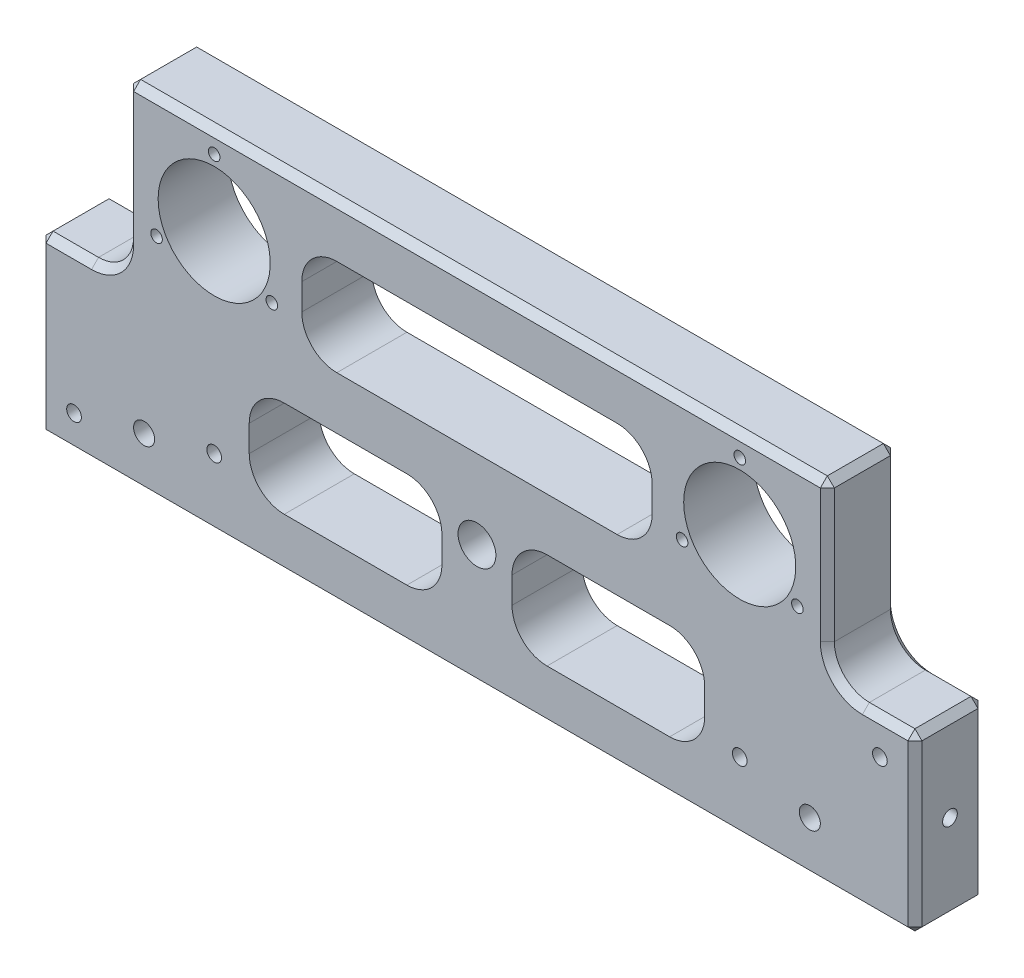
ISO-10303-21;
HEADER;
FILE_DESCRIPTION(('STEP AP214'),'2;1');
FILE_NAME('part.step','',(''),(''),'','','');
FILE_SCHEMA(('AUTOMOTIVE_DESIGN { 1 0 10303 214 1 1 1 1 }'));
ENDSEC;
DATA;
#1=APPLICATION_CONTEXT('core data for automotive mechanical design processes');
#2=APPLICATION_PROTOCOL_DEFINITION('international standard','automotive_design',2000,#1);
#3=PRODUCT_CONTEXT('',#1,'mechanical');
#4=PRODUCT('Part','Part','',(#3));
#5=PRODUCT_RELATED_PRODUCT_CATEGORY('part','',(#4));
#6=PRODUCT_DEFINITION_FORMATION('','',#4);
#7=PRODUCT_DEFINITION_CONTEXT('part definition',#1,'design');
#8=PRODUCT_DEFINITION('design','',#6,#7);
#9=PRODUCT_DEFINITION_SHAPE('','',#8);
#10=(LENGTH_UNIT() NAMED_UNIT(*) SI_UNIT(.MILLI.,.METRE.));
#11=(NAMED_UNIT(*) PLANE_ANGLE_UNIT() SI_UNIT($,.RADIAN.));
#12=(NAMED_UNIT(*) SI_UNIT($,.STERADIAN.) SOLID_ANGLE_UNIT());
#13=UNCERTAINTY_MEASURE_WITH_UNIT(LENGTH_MEASURE(1.E-05),#10,'distance_accuracy_value','');
#14=(GEOMETRIC_REPRESENTATION_CONTEXT(3) GLOBAL_UNCERTAINTY_ASSIGNED_CONTEXT((#13)) GLOBAL_UNIT_ASSIGNED_CONTEXT((#10,
#11,#12)) REPRESENTATION_CONTEXT('',''));
#15=CARTESIAN_POINT('',(0.,0.,0.));
#16=DIRECTION('',(0.,0.,1.));
#17=DIRECTION('',(1.,0.,0.));
#18=AXIS2_PLACEMENT_3D('',#15,#16,#17);
#19=CARTESIAN_POINT('',(0.,0.,0.));
#20=DIRECTION('',(0.,0.,1.));
#21=DIRECTION('',(1.,0.,0.));
#22=AXIS2_PLACEMENT_3D('',#19,#20,#21);
#23=PLANE('',#22);
#24=CARTESIAN_POINT('',(95.,-35.,0.));
#25=DIRECTION('',(0.,0.,1.));
#26=DIRECTION('',(1.,0.,0.));
#27=AXIS2_PLACEMENT_3D('',#24,#25,#26);
#28=CIRCLE('',#27,3.00000000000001);
#29=CARTESIAN_POINT('',(98.,-35.,0.));
#30=VERTEX_POINT('',#29);
#31=EDGE_CURVE('E2366',#30,#30,#28,.T.);
#32=ORIENTED_EDGE('',*,*,#31,.T.);
#33=EDGE_LOOP('',(#32));
#34=FACE_BOUND('',#33,.T.);
#35=CARTESIAN_POINT('',(-95.,-35.,0.));
#36=DIRECTION('',(0.,0.,1.));
#37=DIRECTION('',(1.,0.,0.));
#38=AXIS2_PLACEMENT_3D('',#35,#36,#37);
#39=CIRCLE('',#38,3.00000000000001);
#40=CARTESIAN_POINT('',(-92.,-35.,0.));
#41=VERTEX_POINT('',#40);
#42=EDGE_CURVE('E798',#41,#41,#39,.T.);
#43=ORIENTED_EDGE('',*,*,#42,.T.);
#44=EDGE_LOOP('',(#43));
#45=FACE_BOUND('',#44,.T.);
#46=DIRECTION('',(1.,0.,0.));
#47=VECTOR('',#46,1.);
#48=CARTESIAN_POINT('',(100.,48.,0.));
#49=LINE('',#48,#47);
#50=CARTESIAN_POINT('',(-98.,48.,0.));
#51=VERTEX_POINT('',#50);
#52=CARTESIAN_POINT('',(98.,48.,0.));
#53=VERTEX_POINT('',#52);
#54=EDGE_CURVE('E705',#51,#53,#49,.T.);
#55=ORIENTED_EDGE('',*,*,#54,.T.);
#56=DIRECTION('',(0.,-1.,0.));
#57=VECTOR('',#56,1.);
#58=CARTESIAN_POINT('',(98.,0.,0.));
#59=LINE('',#58,#57);
#60=CARTESIAN_POINT('',(98.,9.99999999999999,0.));
#61=VERTEX_POINT('',#60);
#62=EDGE_CURVE('E713',#53,#61,#59,.T.);
#63=ORIENTED_EDGE('',*,*,#62,.T.);
#64=CARTESIAN_POINT('',(110.,9.99999999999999,0.));
#65=DIRECTION('',(0.,0.,1.));
#66=DIRECTION('',(1.,0.,0.));
#67=AXIS2_PLACEMENT_3D('',#64,#65,#66);
#68=CIRCLE('',#67,12.);
#69=CARTESIAN_POINT('',(110.,-2.,0.));
#70=VERTEX_POINT('',#69);
#71=EDGE_CURVE('E711',#61,#70,#68,.T.);
#72=ORIENTED_EDGE('',*,*,#71,.T.);
#73=DIRECTION('',(1.,0.,0.));
#74=VECTOR('',#73,1.);
#75=CARTESIAN_POINT('',(0.,-2.,0.));
#76=LINE('',#75,#74);
#77=CARTESIAN_POINT('',(123.,-2.,0.));
#78=VERTEX_POINT('',#77);
#79=EDGE_CURVE('E709',#70,#78,#76,.T.);
#80=ORIENTED_EDGE('',*,*,#79,.T.);
#81=DIRECTION('',(0.,-1.,0.));
#82=VECTOR('',#81,1.);
#83=CARTESIAN_POINT('',(123.,-50.,0.));
#84=LINE('',#83,#82);
#85=CARTESIAN_POINT('',(123.,-48.,0.));
#86=VERTEX_POINT('',#85);
#87=EDGE_CURVE('E707',#78,#86,#84,.T.);
#88=ORIENTED_EDGE('',*,*,#87,.T.);
#89=DIRECTION('',(-1.,0.,0.));
#90=VECTOR('',#89,1.);
#91=CARTESIAN_POINT('',(-125.,-48.,0.));
#92=LINE('',#91,#90);
#93=CARTESIAN_POINT('',(-123.,-48.,0.));
#94=VERTEX_POINT('',#93);
#95=EDGE_CURVE('E703',#86,#94,#92,.T.);
#96=ORIENTED_EDGE('',*,*,#95,.T.);
#97=DIRECTION('',(0.,1.,0.));
#98=VECTOR('',#97,1.);
#99=CARTESIAN_POINT('',(-123.,0.,0.));
#100=LINE('',#99,#98);
#101=CARTESIAN_POINT('',(-123.,-2.,0.));
#102=VERTEX_POINT('',#101);
#103=EDGE_CURVE('E695',#94,#102,#100,.T.);
#104=ORIENTED_EDGE('',*,*,#103,.T.);
#105=DIRECTION('',(1.,0.,0.));
#106=VECTOR('',#105,1.);
#107=CARTESIAN_POINT('',(0.,-2.,0.));
#108=LINE('',#107,#106);
#109=CARTESIAN_POINT('',(-110.,-2.,0.));
#110=VERTEX_POINT('',#109);
#111=EDGE_CURVE('E697',#102,#110,#108,.T.);
#112=ORIENTED_EDGE('',*,*,#111,.T.);
#113=CARTESIAN_POINT('',(-110.,9.99999999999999,0.));
#114=DIRECTION('',(0.,0.,1.));
#115=DIRECTION('',(1.,0.,0.));
#116=AXIS2_PLACEMENT_3D('',#113,#114,#115);
#117=CIRCLE('',#116,12.);
#118=CARTESIAN_POINT('',(-98.,9.99999999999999,0.));
#119=VERTEX_POINT('',#118);
#120=EDGE_CURVE('E699',#110,#119,#117,.T.);
#121=ORIENTED_EDGE('',*,*,#120,.T.);
#122=DIRECTION('',(0.,1.,0.));
#123=VECTOR('',#122,1.);
#124=CARTESIAN_POINT('',(-98.,0.,0.));
#125=LINE('',#124,#123);
#126=EDGE_CURVE('E701',#119,#51,#125,.T.);
#127=ORIENTED_EDGE('',*,*,#126,.T.);
#128=EDGE_LOOP('',(#55,#63,#72,#80,#88,#96,#104,#112,#121,#127));
#129=FACE_BOUND('',#128,.T.);
#130=CARTESIAN_POINT('',(115.,-10.,0.));
#131=DIRECTION('',(0.,0.,1.));
#132=DIRECTION('',(1.,0.,0.));
#133=AXIS2_PLACEMENT_3D('',#130,#131,#132);
#134=CIRCLE('',#133,2.09999999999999);
#135=CARTESIAN_POINT('',(117.1,-10.,0.));
#136=VERTEX_POINT('',#135);
#137=EDGE_CURVE('E421',#136,#136,#134,.T.);
#138=ORIENTED_EDGE('',*,*,#137,.T.);
#139=EDGE_LOOP('',(#138));
#140=FACE_BOUND('',#139,.T.);
#141=CARTESIAN_POINT('',(-115.,-40.,0.));
#142=DIRECTION('',(0.,0.,1.));
#143=DIRECTION('',(1.,0.,0.));
#144=AXIS2_PLACEMENT_3D('',#141,#142,#143);
#145=CIRCLE('',#144,2.09999999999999);
#146=CARTESIAN_POINT('',(-112.9,-40.,0.));
#147=VERTEX_POINT('',#146);
#148=EDGE_CURVE('E427',#147,#147,#145,.T.);
#149=ORIENTED_EDGE('',*,*,#148,.T.);
#150=EDGE_LOOP('',(#149));
#151=FACE_BOUND('',#150,.T.);
#152=CARTESIAN_POINT('',(-91.454482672,15.5,0.));
#153=DIRECTION('',(0.,0.,-1.));
#154=DIRECTION('',(-1.,0.,0.));
#155=AXIS2_PLACEMENT_3D('',#152,#153,#154);
#156=CIRCLE('',#155,1.64999999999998);
#157=CARTESIAN_POINT('',(-93.104482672,15.5,0.));
#158=VERTEX_POINT('',#157);
#159=EDGE_CURVE('E430',#158,#158,#156,.T.);
#160=ORIENTED_EDGE('',*,*,#159,.F.);
#161=EDGE_LOOP('',(#160));
#162=FACE_BOUND('',#161,.T.);
#163=CARTESIAN_POINT('',(-75.,44.,0.));
#164=DIRECTION('',(0.,0.,-1.));
#165=DIRECTION('',(-1.,0.,0.));
#166=AXIS2_PLACEMENT_3D('',#163,#164,#165);
#167=CIRCLE('',#166,1.64999999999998);
#168=CARTESIAN_POINT('',(-76.65,44.,0.));
#169=VERTEX_POINT('',#168);
#170=EDGE_CURVE('E436',#169,#169,#167,.T.);
#171=ORIENTED_EDGE('',*,*,#170,.F.);
#172=EDGE_LOOP('',(#171));
#173=FACE_BOUND('',#172,.T.);
#174=CARTESIAN_POINT('',(-58.545517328,15.5,0.));
#175=DIRECTION('',(0.,0.,-1.));
#176=DIRECTION('',(-1.,0.,0.));
#177=AXIS2_PLACEMENT_3D('',#174,#175,#176);
#178=CIRCLE('',#177,1.64999999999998);
#179=CARTESIAN_POINT('',(-60.195517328,15.5,0.));
#180=VERTEX_POINT('',#179);
#181=EDGE_CURVE('E442',#180,#180,#178,.T.);
#182=ORIENTED_EDGE('',*,*,#181,.F.);
#183=EDGE_LOOP('',(#182));
#184=FACE_BOUND('',#183,.T.);
#185=CARTESIAN_POINT('',(75.,44.,0.));
#186=DIRECTION('',(0.,0.,-1.));
#187=DIRECTION('',(-1.,0.,0.));
#188=AXIS2_PLACEMENT_3D('',#185,#186,#187);
#189=CIRCLE('',#188,1.64999999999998);
#190=CARTESIAN_POINT('',(73.35,44.,0.));
#191=VERTEX_POINT('',#190);
#192=EDGE_CURVE('E448',#191,#191,#189,.T.);
#193=ORIENTED_EDGE('',*,*,#192,.F.);
#194=EDGE_LOOP('',(#193));
#195=FACE_BOUND('',#194,.T.);
#196=CARTESIAN_POINT('',(91.454482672,15.5,0.));
#197=DIRECTION('',(0.,0.,-1.));
#198=DIRECTION('',(-1.,0.,0.));
#199=AXIS2_PLACEMENT_3D('',#196,#197,#198);
#200=CIRCLE('',#199,1.64999999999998);
#201=CARTESIAN_POINT('',(89.804482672,15.5,0.));
#202=VERTEX_POINT('',#201);
#203=EDGE_CURVE('E454',#202,#202,#200,.T.);
#204=ORIENTED_EDGE('',*,*,#203,.F.);
#205=EDGE_LOOP('',(#204));
#206=FACE_BOUND('',#205,.T.);
#207=CARTESIAN_POINT('',(0.,-15.,0.));
#208=DIRECTION('',(0.,0.,-1.));
#209=DIRECTION('',(-1.,0.,0.));
#210=AXIS2_PLACEMENT_3D('',#207,#208,#209);
#211=CIRCLE('',#210,5.39999999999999);
#212=CARTESIAN_POINT('',(-5.39999999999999,-15.,0.));
#213=VERTEX_POINT('',#212);
#214=EDGE_CURVE('E466',#213,#213,#211,.T.);
#215=ORIENTED_EDGE('',*,*,#214,.F.);
#216=EDGE_LOOP('',(#215));
#217=FACE_BOUND('',#216,.T.);
#218=CARTESIAN_POINT('',(-75.,-30.,0.));
#219=DIRECTION('',(0.,0.,-1.));
#220=DIRECTION('',(-1.,0.,0.));
#221=AXIS2_PLACEMENT_3D('',#218,#219,#220);
#222=CIRCLE('',#221,2.09999999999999);
#223=CARTESIAN_POINT('',(-77.1,-30.,0.));
#224=VERTEX_POINT('',#223);
#225=EDGE_CURVE('E472',#224,#224,#222,.T.);
#226=ORIENTED_EDGE('',*,*,#225,.F.);
#227=EDGE_LOOP('',(#226));
#228=FACE_BOUND('',#227,.T.);
#229=CARTESIAN_POINT('',(75.,-30.,0.));
#230=DIRECTION('',(0.,0.,-1.));
#231=DIRECTION('',(-1.,0.,0.));
#232=AXIS2_PLACEMENT_3D('',#229,#230,#231);
#233=CIRCLE('',#232,2.09999999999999);
#234=CARTESIAN_POINT('',(72.9,-30.,0.));
#235=VERTEX_POINT('',#234);
#236=EDGE_CURVE('E478',#235,#235,#233,.T.);
#237=ORIENTED_EDGE('',*,*,#236,.F.);
#238=EDGE_LOOP('',(#237));
#239=FACE_BOUND('',#238,.T.);
#240=CARTESIAN_POINT('',(-75.,25.,0.));
#241=DIRECTION('',(0.,0.,-1.));
#242=DIRECTION('',(-1.,0.,0.));
#243=AXIS2_PLACEMENT_3D('',#240,#241,#242);
#244=CIRCLE('',#243,16.);
#245=CARTESIAN_POINT('',(-91.,25.,0.));
#246=VERTEX_POINT('',#245);
#247=EDGE_CURVE('E484',#246,#246,#244,.T.);
#248=ORIENTED_EDGE('',*,*,#247,.F.);
#249=EDGE_LOOP('',(#248));
#250=FACE_BOUND('',#249,.T.);
#251=DIRECTION('',(1.,0.,0.));
#252=VECTOR('',#251,1.);
#253=CARTESIAN_POINT('',(9.99999999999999,-35.,0.));
#254=LINE('',#253,#252);
#255=CARTESIAN_POINT('',(20.,-35.,0.));
#256=VERTEX_POINT('',#255);
#257=CARTESIAN_POINT('',(55.,-35.,0.));
#258=VERTEX_POINT('',#257);
#259=EDGE_CURVE('E504',#256,#258,#254,.T.);
#260=ORIENTED_EDGE('',*,*,#259,.T.);
#261=CARTESIAN_POINT('',(55.,-25.,0.));
#262=DIRECTION('',(0.,0.,1.));
#263=DIRECTION('',(1.,0.,0.));
#264=AXIS2_PLACEMENT_3D('',#261,#262,#263);
#265=CIRCLE('',#264,9.99999999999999);
#266=CARTESIAN_POINT('',(65.,-25.,0.));
#267=VERTEX_POINT('',#266);
#268=EDGE_CURVE('E654',#258,#267,#265,.T.);
#269=ORIENTED_EDGE('',*,*,#268,.T.);
#270=DIRECTION('',(0.,1.,0.));
#271=VECTOR('',#270,1.);
#272=CARTESIAN_POINT('',(65.,-35.,0.));
#273=LINE('',#272,#271);
#274=CARTESIAN_POINT('',(65.,-17.5,0.));
#275=VERTEX_POINT('',#274);
#276=EDGE_CURVE('E507',#267,#275,#273,.T.);
#277=ORIENTED_EDGE('',*,*,#276,.T.);
#278=CARTESIAN_POINT('',(55.,-17.5,0.));
#279=DIRECTION('',(0.,0.,1.));
#280=DIRECTION('',(1.,0.,0.));
#281=AXIS2_PLACEMENT_3D('',#278,#279,#280);
#282=CIRCLE('',#281,9.99999999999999);
#283=CARTESIAN_POINT('',(55.,-7.5,0.));
#284=VERTEX_POINT('',#283);
#285=EDGE_CURVE('E658',#275,#284,#282,.T.);
#286=ORIENTED_EDGE('',*,*,#285,.T.);
#287=DIRECTION('',(-1.,0.,0.));
#288=VECTOR('',#287,1.);
#289=CARTESIAN_POINT('',(65.,-7.5,0.));
#290=LINE('',#289,#288);
#291=CARTESIAN_POINT('',(20.,-7.5,0.));
#292=VERTEX_POINT('',#291);
#293=EDGE_CURVE('E497',#284,#292,#290,.T.);
#294=ORIENTED_EDGE('',*,*,#293,.T.);
#295=CARTESIAN_POINT('',(20.,-17.5,0.));
#296=DIRECTION('',(0.,0.,1.));
#297=DIRECTION('',(1.,0.,0.));
#298=AXIS2_PLACEMENT_3D('',#295,#296,#297);
#299=CIRCLE('',#298,9.99999999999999);
#300=CARTESIAN_POINT('',(9.99999999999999,-17.5,0.));
#301=VERTEX_POINT('',#300);
#302=EDGE_CURVE('E662',#292,#301,#299,.T.);
#303=ORIENTED_EDGE('',*,*,#302,.T.);
#304=DIRECTION('',(0.,-1.,0.));
#305=VECTOR('',#304,1.);
#306=CARTESIAN_POINT('',(9.99999999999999,-7.5,0.));
#307=LINE('',#306,#305);
#308=CARTESIAN_POINT('',(9.99999999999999,-25.,0.));
#309=VERTEX_POINT('',#308);
#310=EDGE_CURVE('E500',#301,#309,#307,.T.);
#311=ORIENTED_EDGE('',*,*,#310,.T.);
#312=CARTESIAN_POINT('',(20.,-25.,0.));
#313=DIRECTION('',(0.,0.,1.));
#314=DIRECTION('',(1.,0.,0.));
#315=AXIS2_PLACEMENT_3D('',#312,#313,#314);
#316=CIRCLE('',#315,9.99999999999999);
#317=EDGE_CURVE('E686',#309,#256,#316,.T.);
#318=ORIENTED_EDGE('',*,*,#317,.T.);
#319=EDGE_LOOP('',(#260,#269,#277,#286,#294,#303,#311,#318));
#320=FACE_BOUND('',#319,.T.);
#321=DIRECTION('',(-1.,0.,0.));
#322=VECTOR('',#321,1.);
#323=CARTESIAN_POINT('',(-10.,-7.5,0.));
#324=LINE('',#323,#322);
#325=CARTESIAN_POINT('',(-20.,-7.5,0.));
#326=VERTEX_POINT('',#325);
#327=CARTESIAN_POINT('',(-55.,-7.5,0.));
#328=VERTEX_POINT('',#327);
#329=EDGE_CURVE('E528',#326,#328,#324,.T.);
#330=ORIENTED_EDGE('',*,*,#329,.T.);
#331=CARTESIAN_POINT('',(-55.,-17.5,0.));
#332=DIRECTION('',(0.,0.,1.));
#333=DIRECTION('',(1.,0.,0.));
#334=AXIS2_PLACEMENT_3D('',#331,#332,#333);
#335=CIRCLE('',#334,9.99999999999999);
#336=CARTESIAN_POINT('',(-65.,-17.5,0.));
#337=VERTEX_POINT('',#336);
#338=EDGE_CURVE('E670',#328,#337,#335,.T.);
#339=ORIENTED_EDGE('',*,*,#338,.T.);
#340=DIRECTION('',(0.,-1.,0.));
#341=VECTOR('',#340,1.);
#342=CARTESIAN_POINT('',(-65.,-7.5,0.));
#343=LINE('',#342,#341);
#344=CARTESIAN_POINT('',(-65.,-25.,0.));
#345=VERTEX_POINT('',#344);
#346=EDGE_CURVE('E531',#337,#345,#343,.T.);
#347=ORIENTED_EDGE('',*,*,#346,.T.);
#348=CARTESIAN_POINT('',(-55.,-25.,0.));
#349=DIRECTION('',(0.,0.,1.));
#350=DIRECTION('',(1.,0.,0.));
#351=AXIS2_PLACEMENT_3D('',#348,#349,#350);
#352=CIRCLE('',#351,9.99999999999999);
#353=CARTESIAN_POINT('',(-55.,-35.,0.));
#354=VERTEX_POINT('',#353);
#355=EDGE_CURVE('E650',#345,#354,#352,.T.);
#356=ORIENTED_EDGE('',*,*,#355,.T.);
#357=DIRECTION('',(1.,0.,0.));
#358=VECTOR('',#357,1.);
#359=CARTESIAN_POINT('',(-65.,-35.,0.));
#360=LINE('',#359,#358);
#361=CARTESIAN_POINT('',(-20.,-35.,0.));
#362=VERTEX_POINT('',#361);
#363=EDGE_CURVE('E521',#354,#362,#360,.T.);
#364=ORIENTED_EDGE('',*,*,#363,.T.);
#365=CARTESIAN_POINT('',(-20.,-25.,0.));
#366=DIRECTION('',(0.,0.,1.));
#367=DIRECTION('',(1.,0.,0.));
#368=AXIS2_PLACEMENT_3D('',#365,#366,#367);
#369=CIRCLE('',#368,9.99999999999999);
#370=CARTESIAN_POINT('',(-10.,-25.,0.));
#371=VERTEX_POINT('',#370);
#372=EDGE_CURVE('E674',#362,#371,#369,.T.);
#373=ORIENTED_EDGE('',*,*,#372,.T.);
#374=DIRECTION('',(0.,1.,0.));
#375=VECTOR('',#374,1.);
#376=CARTESIAN_POINT('',(-10.,-35.,0.));
#377=LINE('',#376,#375);
#378=CARTESIAN_POINT('',(-10.,-17.5,0.));
#379=VERTEX_POINT('',#378);
#380=EDGE_CURVE('E524',#371,#379,#377,.T.);
#381=ORIENTED_EDGE('',*,*,#380,.T.);
#382=CARTESIAN_POINT('',(-20.,-17.5,0.));
#383=DIRECTION('',(0.,0.,1.));
#384=DIRECTION('',(1.,0.,0.));
#385=AXIS2_PLACEMENT_3D('',#382,#383,#384);
#386=CIRCLE('',#385,9.99999999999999);
#387=EDGE_CURVE('E646',#379,#326,#386,.T.);
#388=ORIENTED_EDGE('',*,*,#387,.T.);
#389=EDGE_LOOP('',(#330,#339,#347,#356,#364,#373,#381,#388));
#390=FACE_BOUND('',#389,.T.);
#391=DIRECTION('',(-1.,0.,0.));
#392=VECTOR('',#391,1.);
#393=CARTESIAN_POINT('',(50.,35.,0.));
#394=LINE('',#393,#392);
#395=CARTESIAN_POINT('',(40.,35.,0.));
#396=VERTEX_POINT('',#395);
#397=CARTESIAN_POINT('',(-40.,35.,0.));
#398=VERTEX_POINT('',#397);
#399=EDGE_CURVE('E552',#396,#398,#394,.T.);
#400=ORIENTED_EDGE('',*,*,#399,.T.);
#401=CARTESIAN_POINT('',(-40.,25.,0.));
#402=DIRECTION('',(0.,0.,1.));
#403=DIRECTION('',(1.,0.,0.));
#404=AXIS2_PLACEMENT_3D('',#401,#402,#403);
#405=CIRCLE('',#404,9.99999999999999);
#406=CARTESIAN_POINT('',(-50.,25.,0.));
#407=VERTEX_POINT('',#406);
#408=EDGE_CURVE('E682',#398,#407,#405,.T.);
#409=ORIENTED_EDGE('',*,*,#408,.T.);
#410=DIRECTION('',(0.,-1.,0.));
#411=VECTOR('',#410,1.);
#412=CARTESIAN_POINT('',(-50.,35.,0.));
#413=LINE('',#412,#411);
#414=CARTESIAN_POINT('',(-50.,17.5,0.));
#415=VERTEX_POINT('',#414);
#416=EDGE_CURVE('E555',#407,#415,#413,.T.);
#417=ORIENTED_EDGE('',*,*,#416,.T.);
#418=CARTESIAN_POINT('',(-40.,17.5,0.));
#419=DIRECTION('',(0.,0.,1.));
#420=DIRECTION('',(1.,0.,0.));
#421=AXIS2_PLACEMENT_3D('',#418,#419,#420);
#422=CIRCLE('',#421,9.99999999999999);
#423=CARTESIAN_POINT('',(-40.,7.5,0.));
#424=VERTEX_POINT('',#423);
#425=EDGE_CURVE('E678',#415,#424,#422,.T.);
#426=ORIENTED_EDGE('',*,*,#425,.T.);
#427=DIRECTION('',(1.,0.,0.));
#428=VECTOR('',#427,1.);
#429=CARTESIAN_POINT('',(-50.,7.5,0.));
#430=LINE('',#429,#428);
#431=CARTESIAN_POINT('',(40.,7.5,0.));
#432=VERTEX_POINT('',#431);
#433=EDGE_CURVE('E545',#424,#432,#430,.T.);
#434=ORIENTED_EDGE('',*,*,#433,.T.);
#435=CARTESIAN_POINT('',(40.,17.5,0.));
#436=DIRECTION('',(0.,0.,1.));
#437=DIRECTION('',(1.,0.,0.));
#438=AXIS2_PLACEMENT_3D('',#435,#436,#437);
#439=CIRCLE('',#438,9.99999999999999);
#440=CARTESIAN_POINT('',(50.,17.5,0.));
#441=VERTEX_POINT('',#440);
#442=EDGE_CURVE('E666',#432,#441,#439,.T.);
#443=ORIENTED_EDGE('',*,*,#442,.T.);
#444=DIRECTION('',(0.,1.,0.));
#445=VECTOR('',#444,1.);
#446=CARTESIAN_POINT('',(50.,7.5,0.));
#447=LINE('',#446,#445);
#448=CARTESIAN_POINT('',(50.,25.,0.));
#449=VERTEX_POINT('',#448);
#450=EDGE_CURVE('E548',#441,#449,#447,.T.);
#451=ORIENTED_EDGE('',*,*,#450,.T.);
#452=CARTESIAN_POINT('',(40.,25.,0.));
#453=DIRECTION('',(0.,0.,1.));
#454=DIRECTION('',(1.,0.,0.));
#455=AXIS2_PLACEMENT_3D('',#452,#453,#454);
#456=CIRCLE('',#455,9.99999999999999);
#457=EDGE_CURVE('E642',#449,#396,#456,.T.);
#458=ORIENTED_EDGE('',*,*,#457,.T.);
#459=EDGE_LOOP('',(#400,#409,#417,#426,#434,#443,#451,#458));
#460=FACE_BOUND('',#459,.T.);
#461=CARTESIAN_POINT('',(75.,25.,0.));
#462=DIRECTION('',(0.,0.,-1.));
#463=DIRECTION('',(-1.,0.,0.));
#464=AXIS2_PLACEMENT_3D('',#461,#462,#463);
#465=CIRCLE('',#464,16.);
#466=CARTESIAN_POINT('',(59.,25.,0.));
#467=VERTEX_POINT('',#466);
#468=EDGE_CURVE('E490',#467,#467,#465,.T.);
#469=ORIENTED_EDGE('',*,*,#468,.F.);
#470=EDGE_LOOP('',(#469));
#471=FACE_BOUND('',#470,.T.);
#472=CARTESIAN_POINT('',(58.545517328,15.5,0.));
#473=DIRECTION('',(0.,0.,-1.));
#474=DIRECTION('',(-1.,0.,0.));
#475=AXIS2_PLACEMENT_3D('',#472,#473,#474);
#476=CIRCLE('',#475,1.64999999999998);
#477=CARTESIAN_POINT('',(56.895517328,15.5,0.));
#478=VERTEX_POINT('',#477);
#479=EDGE_CURVE('E460',#478,#478,#476,.T.);
#480=ORIENTED_EDGE('',*,*,#479,.F.);
#481=EDGE_LOOP('',(#480));
#482=FACE_BOUND('',#481,.T.);
#483=ADVANCED_FACE('F44',(#34,#45,#129,#140,#151,#162,#173,#184,#195,#206,#217,#228,#239,#250,
#320,#390,#460,#471,#482),#23,.F.);
#484=CARTESIAN_POINT('',(0.,0.,20.));
#485=DIRECTION('',(0.,0.,1.));
#486=DIRECTION('',(1.,0.,0.));
#487=AXIS2_PLACEMENT_3D('',#484,#485,#486);
#488=PLANE('',#487);
#489=CARTESIAN_POINT('',(95.,-35.,20.));
#490=DIRECTION('',(0.,0.,1.));
#491=DIRECTION('',(1.,0.,0.));
#492=AXIS2_PLACEMENT_3D('',#489,#490,#491);
#493=CIRCLE('',#492,3.00000000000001);
#494=CARTESIAN_POINT('',(98.,-35.,20.));
#495=VERTEX_POINT('',#494);
#496=EDGE_CURVE('E2368',#495,#495,#493,.T.);
#497=ORIENTED_EDGE('',*,*,#496,.F.);
#498=EDGE_LOOP('',(#497));
#499=FACE_BOUND('',#498,.T.);
#500=CARTESIAN_POINT('',(-95.,-35.,20.));
#501=DIRECTION('',(0.,0.,1.));
#502=DIRECTION('',(1.,0.,0.));
#503=AXIS2_PLACEMENT_3D('',#500,#501,#502);
#504=CIRCLE('',#503,3.00000000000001);
#505=CARTESIAN_POINT('',(-92.,-35.,20.));
#506=VERTEX_POINT('',#505);
#507=EDGE_CURVE('E2364',#506,#506,#504,.T.);
#508=ORIENTED_EDGE('',*,*,#507,.F.);
#509=EDGE_LOOP('',(#508));
#510=FACE_BOUND('',#509,.T.);
#511=DIRECTION('',(0.,1.,0.));
#512=VECTOR('',#511,1.);
#513=CARTESIAN_POINT('',(123.,0.,20.));
#514=LINE('',#513,#512);
#515=CARTESIAN_POINT('',(123.,-48.,20.));
#516=VERTEX_POINT('',#515);
#517=CARTESIAN_POINT('',(123.,-1.99999999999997,20.));
#518=VERTEX_POINT('',#517);
#519=EDGE_CURVE('E754',#516,#518,#514,.T.);
#520=ORIENTED_EDGE('',*,*,#519,.T.);
#521=DIRECTION('',(-1.,0.,0.));
#522=VECTOR('',#521,1.);
#523=CARTESIAN_POINT('',(110.,-1.99999999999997,20.));
#524=LINE('',#523,#522);
#525=CARTESIAN_POINT('',(110.,-1.99999999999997,20.));
#526=VERTEX_POINT('',#525);
#527=EDGE_CURVE('E762',#518,#526,#524,.T.);
#528=ORIENTED_EDGE('',*,*,#527,.T.);
#529=CARTESIAN_POINT('',(110.,9.99999999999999,20.));
#530=DIRECTION('',(0.,0.,1.));
#531=DIRECTION('',(1.,0.,0.));
#532=AXIS2_PLACEMENT_3D('',#529,#530,#531);
#533=CIRCLE('',#532,12.);
#534=CARTESIAN_POINT('',(98.,9.99999999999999,20.));
#535=VERTEX_POINT('',#534);
#536=EDGE_CURVE('E760',#526,#535,#533,.F.);
#537=ORIENTED_EDGE('',*,*,#536,.T.);
#538=DIRECTION('',(0.,1.,0.));
#539=VECTOR('',#538,1.);
#540=CARTESIAN_POINT('',(98.,50.,20.));
#541=LINE('',#540,#539);
#542=CARTESIAN_POINT('',(98.,48.,20.));
#543=VERTEX_POINT('',#542);
#544=EDGE_CURVE('E758',#535,#543,#541,.T.);
#545=ORIENTED_EDGE('',*,*,#544,.T.);
#546=DIRECTION('',(-1.,0.,0.));
#547=VECTOR('',#546,1.);
#548=CARTESIAN_POINT('',(0.,48.,20.));
#549=LINE('',#548,#547);
#550=CARTESIAN_POINT('',(-98.,48.,20.));
#551=VERTEX_POINT('',#550);
#552=EDGE_CURVE('E756',#543,#551,#549,.T.);
#553=ORIENTED_EDGE('',*,*,#552,.T.);
#554=DIRECTION('',(0.,-1.,0.));
#555=VECTOR('',#554,1.);
#556=CARTESIAN_POINT('',(-98.,9.99999999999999,20.));
#557=LINE('',#556,#555);
#558=CARTESIAN_POINT('',(-98.,9.99999999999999,20.));
#559=VERTEX_POINT('',#558);
#560=EDGE_CURVE('E752',#551,#559,#557,.T.);
#561=ORIENTED_EDGE('',*,*,#560,.T.);
#562=CARTESIAN_POINT('',(-110.,9.99999999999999,20.));
#563=DIRECTION('',(0.,0.,1.));
#564=DIRECTION('',(1.,0.,0.));
#565=AXIS2_PLACEMENT_3D('',#562,#563,#564);
#566=CIRCLE('',#565,12.);
#567=CARTESIAN_POINT('',(-110.,-1.99999999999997,20.));
#568=VERTEX_POINT('',#567);
#569=EDGE_CURVE('E750',#559,#568,#566,.F.);
#570=ORIENTED_EDGE('',*,*,#569,.T.);
#571=DIRECTION('',(-1.,0.,0.));
#572=VECTOR('',#571,1.);
#573=CARTESIAN_POINT('',(-125.,-1.99999999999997,20.));
#574=LINE('',#573,#572);
#575=CARTESIAN_POINT('',(-123.,-1.99999999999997,20.));
#576=VERTEX_POINT('',#575);
#577=EDGE_CURVE('E748',#568,#576,#574,.T.);
#578=ORIENTED_EDGE('',*,*,#577,.T.);
#579=DIRECTION('',(0.,-1.,0.));
#580=VECTOR('',#579,1.);
#581=CARTESIAN_POINT('',(-123.,0.,20.));
#582=LINE('',#581,#580);
#583=CARTESIAN_POINT('',(-123.,-48.,20.));
#584=VERTEX_POINT('',#583);
#585=EDGE_CURVE('E744',#576,#584,#582,.T.);
#586=ORIENTED_EDGE('',*,*,#585,.T.);
#587=DIRECTION('',(1.,0.,0.));
#588=VECTOR('',#587,1.);
#589=CARTESIAN_POINT('',(0.,-48.,20.));
#590=LINE('',#589,#588);
#591=EDGE_CURVE('E746',#584,#516,#590,.T.);
#592=ORIENTED_EDGE('',*,*,#591,.T.);
#593=EDGE_LOOP('',(#520,#528,#537,#545,#553,#561,#570,#578,#586,#592));
#594=FACE_BOUND('',#593,.T.);
#595=CARTESIAN_POINT('',(115.,-10.,20.));
#596=DIRECTION('',(0.,0.,1.));
#597=DIRECTION('',(1.,0.,0.));
#598=AXIS2_PLACEMENT_3D('',#595,#596,#597);
#599=CIRCLE('',#598,2.09999999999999);
#600=CARTESIAN_POINT('',(117.1,-10.,20.));
#601=VERTEX_POINT('',#600);
#602=EDGE_CURVE('E418',#601,#601,#599,.T.);
#603=ORIENTED_EDGE('',*,*,#602,.F.);
#604=EDGE_LOOP('',(#603));
#605=FACE_BOUND('',#604,.T.);
#606=CARTESIAN_POINT('',(-115.,-40.,20.));
#607=DIRECTION('',(0.,0.,1.));
#608=DIRECTION('',(1.,0.,0.));
#609=AXIS2_PLACEMENT_3D('',#606,#607,#608);
#610=CIRCLE('',#609,2.09999999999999);
#611=CARTESIAN_POINT('',(-112.9,-40.,20.));
#612=VERTEX_POINT('',#611);
#613=EDGE_CURVE('E424',#612,#612,#610,.T.);
#614=ORIENTED_EDGE('',*,*,#613,.F.);
#615=EDGE_LOOP('',(#614));
#616=FACE_BOUND('',#615,.T.);
#617=CARTESIAN_POINT('',(-91.454482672,15.5,20.));
#618=DIRECTION('',(0.,0.,-1.));
#619=DIRECTION('',(-1.,0.,0.));
#620=AXIS2_PLACEMENT_3D('',#617,#618,#619);
#621=CIRCLE('',#620,1.64999999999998);
#622=CARTESIAN_POINT('',(-93.104482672,15.5,20.));
#623=VERTEX_POINT('',#622);
#624=EDGE_CURVE('E433',#623,#623,#621,.T.);
#625=ORIENTED_EDGE('',*,*,#624,.T.);
#626=EDGE_LOOP('',(#625));
#627=FACE_BOUND('',#626,.T.);
#628=CARTESIAN_POINT('',(-75.,44.,20.));
#629=DIRECTION('',(0.,0.,-1.));
#630=DIRECTION('',(-1.,0.,0.));
#631=AXIS2_PLACEMENT_3D('',#628,#629,#630);
#632=CIRCLE('',#631,1.64999999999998);
#633=CARTESIAN_POINT('',(-76.65,44.,20.));
#634=VERTEX_POINT('',#633);
#635=EDGE_CURVE('E439',#634,#634,#632,.T.);
#636=ORIENTED_EDGE('',*,*,#635,.T.);
#637=EDGE_LOOP('',(#636));
#638=FACE_BOUND('',#637,.T.);
#639=CARTESIAN_POINT('',(-58.545517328,15.5,20.));
#640=DIRECTION('',(0.,0.,-1.));
#641=DIRECTION('',(-1.,0.,0.));
#642=AXIS2_PLACEMENT_3D('',#639,#640,#641);
#643=CIRCLE('',#642,1.64999999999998);
#644=CARTESIAN_POINT('',(-60.195517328,15.5,20.));
#645=VERTEX_POINT('',#644);
#646=EDGE_CURVE('E445',#645,#645,#643,.T.);
#647=ORIENTED_EDGE('',*,*,#646,.T.);
#648=EDGE_LOOP('',(#647));
#649=FACE_BOUND('',#648,.T.);
#650=CARTESIAN_POINT('',(75.,44.,20.));
#651=DIRECTION('',(0.,0.,-1.));
#652=DIRECTION('',(-1.,0.,0.));
#653=AXIS2_PLACEMENT_3D('',#650,#651,#652);
#654=CIRCLE('',#653,1.64999999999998);
#655=CARTESIAN_POINT('',(73.35,44.,20.));
#656=VERTEX_POINT('',#655);
#657=EDGE_CURVE('E451',#656,#656,#654,.T.);
#658=ORIENTED_EDGE('',*,*,#657,.T.);
#659=EDGE_LOOP('',(#658));
#660=FACE_BOUND('',#659,.T.);
#661=CARTESIAN_POINT('',(91.454482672,15.5,20.));
#662=DIRECTION('',(0.,0.,-1.));
#663=DIRECTION('',(-1.,0.,0.));
#664=AXIS2_PLACEMENT_3D('',#661,#662,#663);
#665=CIRCLE('',#664,1.64999999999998);
#666=CARTESIAN_POINT('',(89.804482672,15.5,20.));
#667=VERTEX_POINT('',#666);
#668=EDGE_CURVE('E457',#667,#667,#665,.T.);
#669=ORIENTED_EDGE('',*,*,#668,.T.);
#670=EDGE_LOOP('',(#669));
#671=FACE_BOUND('',#670,.T.);
#672=CARTESIAN_POINT('',(58.545517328,15.5,20.));
#673=DIRECTION('',(0.,0.,-1.));
#674=DIRECTION('',(-1.,0.,0.));
#675=AXIS2_PLACEMENT_3D('',#672,#673,#674);
#676=CIRCLE('',#675,1.64999999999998);
#677=CARTESIAN_POINT('',(56.895517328,15.5,20.));
#678=VERTEX_POINT('',#677);
#679=EDGE_CURVE('E463',#678,#678,#676,.T.);
#680=ORIENTED_EDGE('',*,*,#679,.T.);
#681=EDGE_LOOP('',(#680));
#682=FACE_BOUND('',#681,.T.);
#683=CARTESIAN_POINT('',(0.,-15.,20.));
#684=DIRECTION('',(0.,0.,-1.));
#685=DIRECTION('',(-1.,0.,0.));
#686=AXIS2_PLACEMENT_3D('',#683,#684,#685);
#687=CIRCLE('',#686,5.39999999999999);
#688=CARTESIAN_POINT('',(-5.39999999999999,-15.,20.));
#689=VERTEX_POINT('',#688);
#690=EDGE_CURVE('E469',#689,#689,#687,.T.);
#691=ORIENTED_EDGE('',*,*,#690,.T.);
#692=EDGE_LOOP('',(#691));
#693=FACE_BOUND('',#692,.T.);
#694=CARTESIAN_POINT('',(-75.,-30.,20.));
#695=DIRECTION('',(0.,0.,-1.));
#696=DIRECTION('',(-1.,0.,0.));
#697=AXIS2_PLACEMENT_3D('',#694,#695,#696);
#698=CIRCLE('',#697,2.09999999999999);
#699=CARTESIAN_POINT('',(-77.1,-30.,20.));
#700=VERTEX_POINT('',#699);
#701=EDGE_CURVE('E475',#700,#700,#698,.T.);
#702=ORIENTED_EDGE('',*,*,#701,.T.);
#703=EDGE_LOOP('',(#702));
#704=FACE_BOUND('',#703,.T.);
#705=CARTESIAN_POINT('',(75.,-30.,20.));
#706=DIRECTION('',(0.,0.,-1.));
#707=DIRECTION('',(-1.,0.,0.));
#708=AXIS2_PLACEMENT_3D('',#705,#706,#707);
#709=CIRCLE('',#708,2.09999999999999);
#710=CARTESIAN_POINT('',(72.9,-30.,20.));
#711=VERTEX_POINT('',#710);
#712=EDGE_CURVE('E481',#711,#711,#709,.T.);
#713=ORIENTED_EDGE('',*,*,#712,.T.);
#714=EDGE_LOOP('',(#713));
#715=FACE_BOUND('',#714,.T.);
#716=CARTESIAN_POINT('',(-75.,25.,20.));
#717=DIRECTION('',(0.,0.,-1.));
#718=DIRECTION('',(-1.,0.,0.));
#719=AXIS2_PLACEMENT_3D('',#716,#717,#718);
#720=CIRCLE('',#719,16.);
#721=CARTESIAN_POINT('',(-91.,25.,20.));
#722=VERTEX_POINT('',#721);
#723=EDGE_CURVE('E487',#722,#722,#720,.T.);
#724=ORIENTED_EDGE('',*,*,#723,.T.);
#725=EDGE_LOOP('',(#724));
#726=FACE_BOUND('',#725,.T.);
#727=DIRECTION('',(1.,0.,0.));
#728=VECTOR('',#727,1.);
#729=CARTESIAN_POINT('',(-50.,7.5,20.));
#730=LINE('',#729,#728);
#731=CARTESIAN_POINT('',(-40.,7.5,20.));
#732=VERTEX_POINT('',#731);
#733=CARTESIAN_POINT('',(40.,7.5,20.));
#734=VERTEX_POINT('',#733);
#735=EDGE_CURVE('E534',#732,#734,#730,.T.);
#736=ORIENTED_EDGE('',*,*,#735,.F.);
#737=CARTESIAN_POINT('',(-40.,17.5,20.));
#738=DIRECTION('',(0.,0.,1.));
#739=DIRECTION('',(1.,0.,0.));
#740=AXIS2_PLACEMENT_3D('',#737,#738,#739);
#741=CIRCLE('',#740,9.99999999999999);
#742=CARTESIAN_POINT('',(-50.,17.5,20.));
#743=VERTEX_POINT('',#742);
#744=EDGE_CURVE('E676',#732,#743,#741,.F.);
#745=ORIENTED_EDGE('',*,*,#744,.T.);
#746=DIRECTION('',(0.,-1.,0.));
#747=VECTOR('',#746,1.);
#748=CARTESIAN_POINT('',(-50.,35.,20.));
#749=LINE('',#748,#747);
#750=CARTESIAN_POINT('',(-50.,25.,20.));
#751=VERTEX_POINT('',#750);
#752=EDGE_CURVE('E549',#751,#743,#749,.T.);
#753=ORIENTED_EDGE('',*,*,#752,.F.);
#754=CARTESIAN_POINT('',(-40.,25.,20.));
#755=DIRECTION('',(0.,0.,1.));
#756=DIRECTION('',(1.,0.,0.));
#757=AXIS2_PLACEMENT_3D('',#754,#755,#756);
#758=CIRCLE('',#757,9.99999999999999);
#759=CARTESIAN_POINT('',(-40.,35.,20.));
#760=VERTEX_POINT('',#759);
#761=EDGE_CURVE('E680',#751,#760,#758,.F.);
#762=ORIENTED_EDGE('',*,*,#761,.T.);
#763=DIRECTION('',(-1.,0.,0.));
#764=VECTOR('',#763,1.);
#765=CARTESIAN_POINT('',(50.,35.,20.));
#766=LINE('',#765,#764);
#767=CARTESIAN_POINT('',(40.,35.,20.));
#768=VERTEX_POINT('',#767);
#769=EDGE_CURVE('E564',#768,#760,#766,.T.);
#770=ORIENTED_EDGE('',*,*,#769,.F.);
#771=CARTESIAN_POINT('',(40.,25.,20.));
#772=DIRECTION('',(0.,0.,1.));
#773=DIRECTION('',(1.,0.,0.));
#774=AXIS2_PLACEMENT_3D('',#771,#772,#773);
#775=CIRCLE('',#774,9.99999999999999);
#776=CARTESIAN_POINT('',(50.,25.,20.));
#777=VERTEX_POINT('',#776);
#778=EDGE_CURVE('E640',#768,#777,#775,.F.);
#779=ORIENTED_EDGE('',*,*,#778,.T.);
#780=DIRECTION('',(0.,1.,0.));
#781=VECTOR('',#780,1.);
#782=CARTESIAN_POINT('',(50.,7.5,20.));
#783=LINE('',#782,#781);
#784=CARTESIAN_POINT('',(50.,17.5,20.));
#785=VERTEX_POINT('',#784);
#786=EDGE_CURVE('E561',#785,#777,#783,.T.);
#787=ORIENTED_EDGE('',*,*,#786,.F.);
#788=CARTESIAN_POINT('',(40.,17.5,20.));
#789=DIRECTION('',(0.,0.,1.));
#790=DIRECTION('',(1.,0.,0.));
#791=AXIS2_PLACEMENT_3D('',#788,#789,#790);
#792=CIRCLE('',#791,9.99999999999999);
#793=EDGE_CURVE('E664',#785,#734,#792,.F.);
#794=ORIENTED_EDGE('',*,*,#793,.T.);
#795=EDGE_LOOP('',(#736,#745,#753,#762,#770,#779,#787,#794));
#796=FACE_BOUND('',#795,.T.);
#797=DIRECTION('',(1.,0.,0.));
#798=VECTOR('',#797,1.);
#799=CARTESIAN_POINT('',(-65.,-35.,20.));
#800=LINE('',#799,#798);
#801=CARTESIAN_POINT('',(-55.,-35.,20.));
#802=VERTEX_POINT('',#801);
#803=CARTESIAN_POINT('',(-20.,-35.,20.));
#804=VERTEX_POINT('',#803);
#805=EDGE_CURVE('E510',#802,#804,#800,.T.);
#806=ORIENTED_EDGE('',*,*,#805,.F.);
#807=CARTESIAN_POINT('',(-55.,-25.,20.));
#808=DIRECTION('',(0.,0.,1.));
#809=DIRECTION('',(1.,0.,0.));
#810=AXIS2_PLACEMENT_3D('',#807,#808,#809);
#811=CIRCLE('',#810,9.99999999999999);
#812=CARTESIAN_POINT('',(-65.,-25.,20.));
#813=VERTEX_POINT('',#812);
#814=EDGE_CURVE('E648',#802,#813,#811,.F.);
#815=ORIENTED_EDGE('',*,*,#814,.T.);
#816=DIRECTION('',(0.,-1.,0.));
#817=VECTOR('',#816,1.);
#818=CARTESIAN_POINT('',(-65.,-7.5,20.));
#819=LINE('',#818,#817);
#820=CARTESIAN_POINT('',(-65.,-17.5,20.));
#821=VERTEX_POINT('',#820);
#822=EDGE_CURVE('E525',#821,#813,#819,.T.);
#823=ORIENTED_EDGE('',*,*,#822,.F.);
#824=CARTESIAN_POINT('',(-55.,-17.5,20.));
#825=DIRECTION('',(0.,0.,1.));
#826=DIRECTION('',(1.,0.,0.));
#827=AXIS2_PLACEMENT_3D('',#824,#825,#826);
#828=CIRCLE('',#827,9.99999999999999);
#829=CARTESIAN_POINT('',(-55.,-7.5,20.));
#830=VERTEX_POINT('',#829);
#831=EDGE_CURVE('E668',#821,#830,#828,.F.);
#832=ORIENTED_EDGE('',*,*,#831,.T.);
#833=DIRECTION('',(-1.,0.,0.));
#834=VECTOR('',#833,1.);
#835=CARTESIAN_POINT('',(-10.,-7.5,20.));
#836=LINE('',#835,#834);
#837=CARTESIAN_POINT('',(-20.,-7.5,20.));
#838=VERTEX_POINT('',#837);
#839=EDGE_CURVE('E540',#838,#830,#836,.T.);
#840=ORIENTED_EDGE('',*,*,#839,.F.);
#841=CARTESIAN_POINT('',(-20.,-17.5,20.));
#842=DIRECTION('',(0.,0.,1.));
#843=DIRECTION('',(1.,0.,0.));
#844=AXIS2_PLACEMENT_3D('',#841,#842,#843);
#845=CIRCLE('',#844,9.99999999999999);
#846=CARTESIAN_POINT('',(-10.,-17.5,20.));
#847=VERTEX_POINT('',#846);
#848=EDGE_CURVE('E644',#838,#847,#845,.F.);
#849=ORIENTED_EDGE('',*,*,#848,.T.);
#850=DIRECTION('',(0.,1.,0.));
#851=VECTOR('',#850,1.);
#852=CARTESIAN_POINT('',(-10.,-35.,20.));
#853=LINE('',#852,#851);
#854=CARTESIAN_POINT('',(-10.,-25.,20.));
#855=VERTEX_POINT('',#854);
#856=EDGE_CURVE('E537',#855,#847,#853,.T.);
#857=ORIENTED_EDGE('',*,*,#856,.F.);
#858=CARTESIAN_POINT('',(-20.,-25.,20.));
#859=DIRECTION('',(0.,0.,1.));
#860=DIRECTION('',(1.,0.,0.));
#861=AXIS2_PLACEMENT_3D('',#858,#859,#860);
#862=CIRCLE('',#861,9.99999999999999);
#863=EDGE_CURVE('E672',#855,#804,#862,.F.);
#864=ORIENTED_EDGE('',*,*,#863,.T.);
#865=EDGE_LOOP('',(#806,#815,#823,#832,#840,#849,#857,#864));
#866=FACE_BOUND('',#865,.T.);
#867=DIRECTION('',(-1.,0.,0.));
#868=VECTOR('',#867,1.);
#869=CARTESIAN_POINT('',(65.,-7.5,20.));
#870=LINE('',#869,#868);
#871=CARTESIAN_POINT('',(55.,-7.5,20.));
#872=VERTEX_POINT('',#871);
#873=CARTESIAN_POINT('',(20.,-7.5,20.));
#874=VERTEX_POINT('',#873);
#875=EDGE_CURVE('E496',#872,#874,#870,.T.);
#876=ORIENTED_EDGE('',*,*,#875,.F.);
#877=CARTESIAN_POINT('',(55.,-17.5,20.));
#878=DIRECTION('',(0.,0.,1.));
#879=DIRECTION('',(1.,0.,0.));
#880=AXIS2_PLACEMENT_3D('',#877,#878,#879);
#881=CIRCLE('',#880,9.99999999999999);
#882=CARTESIAN_POINT('',(65.,-17.5,20.));
#883=VERTEX_POINT('',#882);
#884=EDGE_CURVE('E656',#872,#883,#881,.F.);
#885=ORIENTED_EDGE('',*,*,#884,.T.);
#886=DIRECTION('',(0.,1.,0.));
#887=VECTOR('',#886,1.);
#888=CARTESIAN_POINT('',(65.,-35.,20.));
#889=LINE('',#888,#887);
#890=CARTESIAN_POINT('',(65.,-25.,20.));
#891=VERTEX_POINT('',#890);
#892=EDGE_CURVE('E501',#891,#883,#889,.T.);
#893=ORIENTED_EDGE('',*,*,#892,.F.);
#894=CARTESIAN_POINT('',(55.,-25.,20.));
#895=DIRECTION('',(0.,0.,1.));
#896=DIRECTION('',(1.,0.,0.));
#897=AXIS2_PLACEMENT_3D('',#894,#895,#896);
#898=CIRCLE('',#897,9.99999999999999);
#899=CARTESIAN_POINT('',(55.,-35.,20.));
#900=VERTEX_POINT('',#899);
#901=EDGE_CURVE('E652',#891,#900,#898,.F.);
#902=ORIENTED_EDGE('',*,*,#901,.T.);
#903=DIRECTION('',(1.,0.,0.));
#904=VECTOR('',#903,1.);
#905=CARTESIAN_POINT('',(9.99999999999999,-35.,20.));
#906=LINE('',#905,#904);
#907=CARTESIAN_POINT('',(20.,-35.,20.));
#908=VERTEX_POINT('',#907);
#909=EDGE_CURVE('E516',#908,#900,#906,.T.);
#910=ORIENTED_EDGE('',*,*,#909,.F.);
#911=CARTESIAN_POINT('',(20.,-25.,20.));
#912=DIRECTION('',(0.,0.,1.));
#913=DIRECTION('',(1.,0.,0.));
#914=AXIS2_PLACEMENT_3D('',#911,#912,#913);
#915=CIRCLE('',#914,9.99999999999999);
#916=CARTESIAN_POINT('',(9.99999999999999,-25.,20.));
#917=VERTEX_POINT('',#916);
#918=EDGE_CURVE('E684',#908,#917,#915,.F.);
#919=ORIENTED_EDGE('',*,*,#918,.T.);
#920=DIRECTION('',(0.,-1.,0.));
#921=VECTOR('',#920,1.);
#922=CARTESIAN_POINT('',(9.99999999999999,-7.5,20.));
#923=LINE('',#922,#921);
#924=CARTESIAN_POINT('',(9.99999999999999,-17.5,20.));
#925=VERTEX_POINT('',#924);
#926=EDGE_CURVE('E513',#925,#917,#923,.T.);
#927=ORIENTED_EDGE('',*,*,#926,.F.);
#928=CARTESIAN_POINT('',(20.,-17.5,20.));
#929=DIRECTION('',(0.,0.,1.));
#930=DIRECTION('',(1.,0.,0.));
#931=AXIS2_PLACEMENT_3D('',#928,#929,#930);
#932=CIRCLE('',#931,9.99999999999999);
#933=EDGE_CURVE('E660',#925,#874,#932,.F.);
#934=ORIENTED_EDGE('',*,*,#933,.T.);
#935=EDGE_LOOP('',(#876,#885,#893,#902,#910,#919,#927,#934));
#936=FACE_BOUND('',#935,.T.);
#937=CARTESIAN_POINT('',(75.,25.,20.));
#938=DIRECTION('',(0.,0.,-1.));
#939=DIRECTION('',(-1.,0.,0.));
#940=AXIS2_PLACEMENT_3D('',#937,#938,#939);
#941=CIRCLE('',#940,16.);
#942=CARTESIAN_POINT('',(59.,25.,20.));
#943=VERTEX_POINT('',#942);
#944=EDGE_CURVE('E493',#943,#943,#941,.T.);
#945=ORIENTED_EDGE('',*,*,#944,.T.);
#946=EDGE_LOOP('',(#945));
#947=FACE_BOUND('',#946,.T.);
#948=ADVANCED_FACE('F943',(#499,#510,#594,#605,#616,#627,#638,#649,#660,#671,#682,#693,#704,
#715,#726,#796,#866,#936,#947),#488,.T.);
#949=CARTESIAN_POINT('',(125.,-50.,0.));
#950=DIRECTION('',(1.,0.,0.));
#951=DIRECTION('',(0.,1.,0.));
#952=AXIS2_PLACEMENT_3D('',#949,#950,#951);
#953=PLANE('',#952);
#954=DIRECTION('',(0.,0.,-1.));
#955=VECTOR('',#954,1.);
#956=CARTESIAN_POINT('',(125.,-48.,0.));
#957=LINE('',#956,#955);
#958=CARTESIAN_POINT('',(125.,-48.,18.));
#959=VERTEX_POINT('',#958);
#960=CARTESIAN_POINT('',(125.,-48.,1.99999999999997));
#961=VERTEX_POINT('',#960);
#962=EDGE_CURVE('E737',#959,#961,#957,.T.);
#963=ORIENTED_EDGE('',*,*,#962,.T.);
#964=DIRECTION('',(0.,1.,0.));
#965=VECTOR('',#964,1.);
#966=CARTESIAN_POINT('',(125.,0.,1.99999999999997));
#967=LINE('',#966,#965);
#968=CARTESIAN_POINT('',(125.,-2.,1.99999999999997));
#969=VERTEX_POINT('',#968);
#970=EDGE_CURVE('E741',#961,#969,#967,.T.);
#971=ORIENTED_EDGE('',*,*,#970,.T.);
#972=DIRECTION('',(0.,0.,1.));
#973=VECTOR('',#972,1.);
#974=CARTESIAN_POINT('',(125.,-2.,20.));
#975=LINE('',#974,#973);
#976=CARTESIAN_POINT('',(125.,-2.,18.));
#977=VERTEX_POINT('',#976);
#978=EDGE_CURVE('E739',#969,#977,#975,.T.);
#979=ORIENTED_EDGE('',*,*,#978,.T.);
#980=DIRECTION('',(0.,-1.,0.));
#981=VECTOR('',#980,1.);
#982=CARTESIAN_POINT('',(125.,-50.,18.));
#983=LINE('',#982,#981);
#984=EDGE_CURVE('E735',#977,#959,#983,.T.);
#985=ORIENTED_EDGE('',*,*,#984,.T.);
#986=EDGE_LOOP('',(#963,#971,#979,#985));
#987=FACE_BOUND('',#986,.T.);
#988=CARTESIAN_POINT('',(125.,-25.,9.99999999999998));
#989=DIRECTION('',(1.,0.,0.));
#990=DIRECTION('',(0.,0.,-1.));
#991=AXIS2_PLACEMENT_3D('',#988,#989,#990);
#992=CIRCLE('',#991,2.1);
#993=CARTESIAN_POINT('',(125.,-25.,7.89999999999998));
#994=VERTEX_POINT('',#993);
#995=EDGE_CURVE('E389',#994,#994,#992,.T.);
#996=ORIENTED_EDGE('',*,*,#995,.F.);
#997=EDGE_LOOP('',(#996));
#998=FACE_BOUND('',#997,.T.);
#999=ADVANCED_FACE('F992',(#987,#998),#953,.T.);
#1000=CARTESIAN_POINT('',(-125.,-50.,0.));
#1001=DIRECTION('',(0.,-1.,0.));
#1002=DIRECTION('',(0.,0.,-1.));
#1003=AXIS2_PLACEMENT_3D('',#1000,#1001,#1002);
#1004=PLANE('',#1003);
#1005=DIRECTION('',(0.,0.,-1.));
#1006=VECTOR('',#1005,1.);
#1007=CARTESIAN_POINT('',(-123.,-50.,0.));
#1008=LINE('',#1007,#1006);
#1009=CARTESIAN_POINT('',(-123.,-50.,18.));
#1010=VERTEX_POINT('',#1009);
#1011=CARTESIAN_POINT('',(-123.,-50.,1.99999999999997));
#1012=VERTEX_POINT('',#1011);
#1013=EDGE_CURVE('E767',#1010,#1012,#1008,.T.);
#1014=ORIENTED_EDGE('',*,*,#1013,.T.);
#1015=DIRECTION('',(1.,0.,0.));
#1016=VECTOR('',#1015,1.);
#1017=CARTESIAN_POINT('',(125.,-50.,1.99999999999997));
#1018=LINE('',#1017,#1016);
#1019=CARTESIAN_POINT('',(123.,-50.,1.99999999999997));
#1020=VERTEX_POINT('',#1019);
#1021=EDGE_CURVE('E771',#1012,#1020,#1018,.T.);
#1022=ORIENTED_EDGE('',*,*,#1021,.T.);
#1023=DIRECTION('',(0.,0.,1.));
#1024=VECTOR('',#1023,1.);
#1025=CARTESIAN_POINT('',(123.,-50.,0.));
#1026=LINE('',#1025,#1024);
#1027=CARTESIAN_POINT('',(123.,-50.,18.));
#1028=VERTEX_POINT('',#1027);
#1029=EDGE_CURVE('E769',#1020,#1028,#1026,.T.);
#1030=ORIENTED_EDGE('',*,*,#1029,.T.);
#1031=DIRECTION('',(-1.,0.,0.));
#1032=VECTOR('',#1031,1.);
#1033=CARTESIAN_POINT('',(-125.,-50.,18.));
#1034=LINE('',#1033,#1032);
#1035=EDGE_CURVE('E765',#1028,#1010,#1034,.T.);
#1036=ORIENTED_EDGE('',*,*,#1035,.T.);
#1037=EDGE_LOOP('',(#1014,#1022,#1030,#1036));
#1038=FACE_BOUND('',#1037,.T.);
#1039=CARTESIAN_POINT('',(0.,-50.,9.99999999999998));
#1040=DIRECTION('',(0.,-1.,0.));
#1041=DIRECTION('',(0.,0.,-1.));
#1042=AXIS2_PLACEMENT_3D('',#1039,#1040,#1041);
#1043=CIRCLE('',#1042,2.1);
#1044=CARTESIAN_POINT('',(0.,-50.,7.89999999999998));
#1045=VERTEX_POINT('',#1044);
#1046=EDGE_CURVE('E388',#1045,#1045,#1043,.T.);
#1047=ORIENTED_EDGE('',*,*,#1046,.F.);
#1048=EDGE_LOOP('',(#1047));
#1049=FACE_BOUND('',#1048,.T.);
#1050=CARTESIAN_POINT('',(105.,-50.,9.99999999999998));
#1051=DIRECTION('',(0.,-1.,0.));
#1052=DIRECTION('',(0.,0.,-1.));
#1053=AXIS2_PLACEMENT_3D('',#1050,#1051,#1052);
#1054=CIRCLE('',#1053,2.1);
#1055=CARTESIAN_POINT('',(105.,-50.,7.89999999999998));
#1056=VERTEX_POINT('',#1055);
#1057=EDGE_CURVE('E400',#1056,#1056,#1054,.T.);
#1058=ORIENTED_EDGE('',*,*,#1057,.F.);
#1059=EDGE_LOOP('',(#1058));
#1060=FACE_BOUND('',#1059,.T.);
#1061=CARTESIAN_POINT('',(-105.,-50.,9.99999999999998));
#1062=DIRECTION('',(0.,-1.,0.));
#1063=DIRECTION('',(0.,0.,-1.));
#1064=AXIS2_PLACEMENT_3D('',#1061,#1062,#1063);
#1065=CIRCLE('',#1064,2.1);
#1066=CARTESIAN_POINT('',(-105.,-50.,7.89999999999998));
#1067=VERTEX_POINT('',#1066);
#1068=EDGE_CURVE('E406',#1067,#1067,#1065,.T.);
#1069=ORIENTED_EDGE('',*,*,#1068,.F.);
#1070=EDGE_LOOP('',(#1069));
#1071=FACE_BOUND('',#1070,.T.);
#1072=ADVANCED_FACE('F933',(#1038,#1049,#1060,#1071),#1004,.T.);
#1073=CARTESIAN_POINT('',(-125.,50.,0.));
#1074=DIRECTION('',(-1.,0.,0.));
#1075=DIRECTION('',(0.,0.,1.));
#1076=AXIS2_PLACEMENT_3D('',#1073,#1074,#1075);
#1077=PLANE('',#1076);
#1078=DIRECTION('',(0.,0.,-1.));
#1079=VECTOR('',#1078,1.);
#1080=CARTESIAN_POINT('',(-125.,-2.,0.));
#1081=LINE('',#1080,#1079);
#1082=CARTESIAN_POINT('',(-125.,-2.,18.));
#1083=VERTEX_POINT('',#1082);
#1084=CARTESIAN_POINT('',(-125.,-2.,2.));
#1085=VERTEX_POINT('',#1084);
#1086=EDGE_CURVE('E68',#1083,#1085,#1081,.T.);
#1087=ORIENTED_EDGE('',*,*,#1086,.T.);
#1088=DIRECTION('',(0.,-1.,0.));
#1089=VECTOR('',#1088,1.);
#1090=CARTESIAN_POINT('',(-125.,-50.,2.));
#1091=LINE('',#1090,#1089);
#1092=CARTESIAN_POINT('',(-125.,-48.,2.));
#1093=VERTEX_POINT('',#1092);
#1094=EDGE_CURVE('E11',#1085,#1093,#1091,.T.);
#1095=ORIENTED_EDGE('',*,*,#1094,.T.);
#1096=DIRECTION('',(0.,0.,1.));
#1097=VECTOR('',#1096,1.);
#1098=CARTESIAN_POINT('',(-125.,-48.,0.));
#1099=LINE('',#1098,#1097);
#1100=CARTESIAN_POINT('',(-125.,-48.,18.));
#1101=VERTEX_POINT('',#1100);
#1102=EDGE_CURVE('E53',#1093,#1101,#1099,.T.);
#1103=ORIENTED_EDGE('',*,*,#1102,.T.);
#1104=DIRECTION('',(0.,1.,0.));
#1105=VECTOR('',#1104,1.);
#1106=CARTESIAN_POINT('',(-125.,50.,18.));
#1107=LINE('',#1106,#1105);
#1108=EDGE_CURVE('E791',#1101,#1083,#1107,.T.);
#1109=ORIENTED_EDGE('',*,*,#1108,.T.);
#1110=EDGE_LOOP('',(#1087,#1095,#1103,#1109));
#1111=FACE_BOUND('',#1110,.T.);
#1112=CARTESIAN_POINT('',(-125.,-25.,9.99999999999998));
#1113=DIRECTION('',(-1.,0.,0.));
#1114=DIRECTION('',(0.,0.,1.));
#1115=AXIS2_PLACEMENT_3D('',#1112,#1113,#1114);
#1116=CIRCLE('',#1115,2.1);
#1117=CARTESIAN_POINT('',(-125.,-25.,12.1));
#1118=VERTEX_POINT('',#1117);
#1119=EDGE_CURVE('E412',#1118,#1118,#1116,.T.);
#1120=ORIENTED_EDGE('',*,*,#1119,.F.);
#1121=EDGE_LOOP('',(#1120));
#1122=FACE_BOUND('',#1121,.T.);
#1123=ADVANCED_FACE('F962',(#1111,#1122),#1077,.T.);
#1124=CARTESIAN_POINT('',(125.,50.,0.));
#1125=DIRECTION('',(0.,1.,0.));
#1126=DIRECTION('',(0.,0.,1.));
#1127=AXIS2_PLACEMENT_3D('',#1124,#1125,#1126);
#1128=PLANE('',#1127);
#1129=DIRECTION('',(1.,0.,0.));
#1130=VECTOR('',#1129,1.);
#1131=CARTESIAN_POINT('',(125.,50.,18.));
#1132=LINE('',#1131,#1130);
#1133=CARTESIAN_POINT('',(-98.,50.,18.));
#1134=VERTEX_POINT('',#1133);
#1135=CARTESIAN_POINT('',(98.,50.,18.));
#1136=VERTEX_POINT('',#1135);
#1137=EDGE_CURVE('E728',#1134,#1136,#1132,.T.);
#1138=ORIENTED_EDGE('',*,*,#1137,.T.);
#1139=DIRECTION('',(0.,0.,-1.));
#1140=VECTOR('',#1139,1.);
#1141=CARTESIAN_POINT('',(98.,50.,0.));
#1142=LINE('',#1141,#1140);
#1143=CARTESIAN_POINT('',(98.,50.,1.99999999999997));
#1144=VERTEX_POINT('',#1143);
#1145=EDGE_CURVE('E732',#1136,#1144,#1142,.T.);
#1146=ORIENTED_EDGE('',*,*,#1145,.T.);
#1147=DIRECTION('',(-1.,0.,0.));
#1148=VECTOR('',#1147,1.);
#1149=CARTESIAN_POINT('',(-100.,50.,1.99999999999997));
#1150=LINE('',#1149,#1148);
#1151=CARTESIAN_POINT('',(-98.,50.,1.99999999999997));
#1152=VERTEX_POINT('',#1151);
#1153=EDGE_CURVE('E730',#1144,#1152,#1150,.T.);
#1154=ORIENTED_EDGE('',*,*,#1153,.T.);
#1155=DIRECTION('',(0.,0.,1.));
#1156=VECTOR('',#1155,1.);
#1157=CARTESIAN_POINT('',(-98.,50.,20.));
#1158=LINE('',#1157,#1156);
#1159=EDGE_CURVE('E726',#1152,#1134,#1158,.T.);
#1160=ORIENTED_EDGE('',*,*,#1159,.T.);
#1161=EDGE_LOOP('',(#1138,#1146,#1154,#1160));
#1162=FACE_BOUND('',#1161,.T.);
#1163=ADVANCED_FACE('F965',(#1162),#1128,.T.);
#1164=CARTESIAN_POINT('',(-100.,50.,20.));
#1165=DIRECTION('',(1.,0.,0.));
#1166=DIRECTION('',(0.,0.,-1.));
#1167=AXIS2_PLACEMENT_3D('',#1164,#1165,#1166);
#1168=PLANE('',#1167);
#1169=DIRECTION('',(0.,0.,-1.));
#1170=VECTOR('',#1169,1.);
#1171=CARTESIAN_POINT('',(-100.,48.,0.));
#1172=LINE('',#1171,#1170);
#1173=CARTESIAN_POINT('',(-100.,48.,18.));
#1174=VERTEX_POINT('',#1173);
#1175=CARTESIAN_POINT('',(-100.,48.,1.99999999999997));
#1176=VERTEX_POINT('',#1175);
#1177=EDGE_CURVE('E776',#1174,#1176,#1172,.T.);
#1178=ORIENTED_EDGE('',*,*,#1177,.T.);
#1179=DIRECTION('',(0.,-1.,0.));
#1180=VECTOR('',#1179,1.);
#1181=CARTESIAN_POINT('',(-100.,50.,1.99999999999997));
#1182=LINE('',#1181,#1180);
#1183=CARTESIAN_POINT('',(-100.,9.99999999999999,2.));
#1184=VERTEX_POINT('',#1183);
#1185=EDGE_CURVE('E779',#1176,#1184,#1182,.T.);
#1186=ORIENTED_EDGE('',*,*,#1185,.T.);
#1187=DIRECTION('',(0.,0.,-1.));
#1188=VECTOR('',#1187,1.);
#1189=CARTESIAN_POINT('',(-100.,9.99999999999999,20.));
#1190=LINE('',#1189,#1188);
#1191=CARTESIAN_POINT('',(-100.,9.99999999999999,18.));
#1192=VERTEX_POINT('',#1191);
#1193=EDGE_CURVE('E631',#1184,#1192,#1190,.F.);
#1194=ORIENTED_EDGE('',*,*,#1193,.T.);
#1195=DIRECTION('',(0.,1.,0.));
#1196=VECTOR('',#1195,1.);
#1197=CARTESIAN_POINT('',(-100.,50.,18.));
#1198=LINE('',#1197,#1196);
#1199=EDGE_CURVE('E774',#1192,#1174,#1198,.T.);
#1200=ORIENTED_EDGE('',*,*,#1199,.T.);
#1201=EDGE_LOOP('',(#1178,#1186,#1194,#1200));
#1202=FACE_BOUND('',#1201,.T.);
#1203=ADVANCED_FACE('F998',(#1202),#1168,.F.);
#1204=CARTESIAN_POINT('',(-100.,0.,20.));
#1205=DIRECTION('',(0.,-1.,0.));
#1206=DIRECTION('',(0.,0.,-1.));
#1207=AXIS2_PLACEMENT_3D('',#1204,#1205,#1206);
#1208=PLANE('',#1207);
#1209=DIRECTION('',(0.,0.,-1.));
#1210=VECTOR('',#1209,1.);
#1211=CARTESIAN_POINT('',(-110.,0.,0.));
#1212=LINE('',#1211,#1210);
#1213=CARTESIAN_POINT('',(-110.,0.,18.));
#1214=VERTEX_POINT('',#1213);
#1215=CARTESIAN_POINT('',(-110.,0.,1.99999999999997));
#1216=VERTEX_POINT('',#1215);
#1217=EDGE_CURVE('E628',#1214,#1216,#1212,.T.);
#1218=ORIENTED_EDGE('',*,*,#1217,.T.);
#1219=DIRECTION('',(-1.,0.,0.));
#1220=VECTOR('',#1219,1.);
#1221=CARTESIAN_POINT('',(-100.,0.,1.99999999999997));
#1222=LINE('',#1221,#1220);
#1223=CARTESIAN_POINT('',(-123.,0.,1.99999999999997));
#1224=VERTEX_POINT('',#1223);
#1225=EDGE_CURVE('E789',#1216,#1224,#1222,.T.);
#1226=ORIENTED_EDGE('',*,*,#1225,.T.);
#1227=DIRECTION('',(0.,0.,1.));
#1228=VECTOR('',#1227,1.);
#1229=CARTESIAN_POINT('',(-123.,0.,20.));
#1230=LINE('',#1229,#1228);
#1231=CARTESIAN_POINT('',(-123.,0.,18.));
#1232=VERTEX_POINT('',#1231);
#1233=EDGE_CURVE('E785',#1224,#1232,#1230,.T.);
#1234=ORIENTED_EDGE('',*,*,#1233,.T.);
#1235=DIRECTION('',(1.,0.,0.));
#1236=VECTOR('',#1235,1.);
#1237=CARTESIAN_POINT('',(-110.,0.,18.));
#1238=LINE('',#1237,#1236);
#1239=EDGE_CURVE('E787',#1232,#1214,#1238,.T.);
#1240=ORIENTED_EDGE('',*,*,#1239,.T.);
#1241=EDGE_LOOP('',(#1218,#1226,#1234,#1240));
#1242=FACE_BOUND('',#1241,.T.);
#1243=ADVANCED_FACE('F1723',(#1242),#1208,.F.);
#1244=CARTESIAN_POINT('',(100.,0.,20.));
#1245=DIRECTION('',(-1.,0.,0.));
#1246=DIRECTION('',(0.,0.,1.));
#1247=AXIS2_PLACEMENT_3D('',#1244,#1245,#1246);
#1248=PLANE('',#1247);
#1249=DIRECTION('',(0.,0.,-1.));
#1250=VECTOR('',#1249,1.);
#1251=CARTESIAN_POINT('',(100.,9.99999999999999,0.));
#1252=LINE('',#1251,#1250);
#1253=CARTESIAN_POINT('',(100.,9.99999999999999,18.));
#1254=VERTEX_POINT('',#1253);
#1255=CARTESIAN_POINT('',(100.,9.99999999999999,2.));
#1256=VERTEX_POINT('',#1255);
#1257=EDGE_CURVE('E634',#1254,#1256,#1252,.T.);
#1258=ORIENTED_EDGE('',*,*,#1257,.T.);
#1259=DIRECTION('',(0.,1.,0.));
#1260=VECTOR('',#1259,1.);
#1261=CARTESIAN_POINT('',(100.,0.,1.99999999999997));
#1262=LINE('',#1261,#1260);
#1263=CARTESIAN_POINT('',(100.,48.,1.99999999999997));
#1264=VERTEX_POINT('',#1263);
#1265=EDGE_CURVE('E692',#1256,#1264,#1262,.T.);
#1266=ORIENTED_EDGE('',*,*,#1265,.T.);
#1267=DIRECTION('',(0.,0.,1.));
#1268=VECTOR('',#1267,1.);
#1269=CARTESIAN_POINT('',(100.,48.,20.));
#1270=LINE('',#1269,#1268);
#1271=CARTESIAN_POINT('',(100.,48.,18.));
#1272=VERTEX_POINT('',#1271);
#1273=EDGE_CURVE('E690',#1264,#1272,#1270,.T.);
#1274=ORIENTED_EDGE('',*,*,#1273,.T.);
#1275=DIRECTION('',(0.,-1.,0.));
#1276=VECTOR('',#1275,1.);
#1277=CARTESIAN_POINT('',(100.,9.99999999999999,18.));
#1278=LINE('',#1277,#1276);
#1279=EDGE_CURVE('E688',#1272,#1254,#1278,.T.);
#1280=ORIENTED_EDGE('',*,*,#1279,.T.);
#1281=EDGE_LOOP('',(#1258,#1266,#1274,#1280));
#1282=FACE_BOUND('',#1281,.T.);
#1283=ADVANCED_FACE('F1730',(#1282),#1248,.F.);
#1284=CARTESIAN_POINT('',(125.,0.,20.));
#1285=DIRECTION('',(0.,-1.,0.));
#1286=DIRECTION('',(0.,0.,-1.));
#1287=AXIS2_PLACEMENT_3D('',#1284,#1285,#1286);
#1288=PLANE('',#1287);
#1289=DIRECTION('',(0.,0.,-1.));
#1290=VECTOR('',#1289,1.);
#1291=CARTESIAN_POINT('',(123.,0.,0.));
#1292=LINE('',#1291,#1290);
#1293=CARTESIAN_POINT('',(123.,0.,18.));
#1294=VERTEX_POINT('',#1293);
#1295=CARTESIAN_POINT('',(123.,0.,1.99999999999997));
#1296=VERTEX_POINT('',#1295);
#1297=EDGE_CURVE('E720',#1294,#1296,#1292,.T.);
#1298=ORIENTED_EDGE('',*,*,#1297,.T.);
#1299=DIRECTION('',(-1.,0.,0.));
#1300=VECTOR('',#1299,1.);
#1301=CARTESIAN_POINT('',(125.,0.,1.99999999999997));
#1302=LINE('',#1301,#1300);
#1303=CARTESIAN_POINT('',(110.,0.,1.99999999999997));
#1304=VERTEX_POINT('',#1303);
#1305=EDGE_CURVE('E724',#1296,#1304,#1302,.T.);
#1306=ORIENTED_EDGE('',*,*,#1305,.T.);
#1307=DIRECTION('',(0.,0.,-1.));
#1308=VECTOR('',#1307,1.);
#1309=CARTESIAN_POINT('',(110.,0.,20.));
#1310=LINE('',#1309,#1308);
#1311=CARTESIAN_POINT('',(110.,0.,18.));
#1312=VERTEX_POINT('',#1311);
#1313=EDGE_CURVE('E637',#1304,#1312,#1310,.F.);
#1314=ORIENTED_EDGE('',*,*,#1313,.T.);
#1315=DIRECTION('',(1.,0.,0.));
#1316=VECTOR('',#1315,1.);
#1317=CARTESIAN_POINT('',(125.,0.,18.));
#1318=LINE('',#1317,#1316);
#1319=EDGE_CURVE('E722',#1312,#1294,#1318,.T.);
#1320=ORIENTED_EDGE('',*,*,#1319,.T.);
#1321=EDGE_LOOP('',(#1298,#1306,#1314,#1320));
#1322=FACE_BOUND('',#1321,.T.);
#1323=ADVANCED_FACE('F1737',(#1322),#1288,.F.);
#1324=CARTESIAN_POINT('',(-50.,7.5,0.));
#1325=DIRECTION('',(0.,-1.,0.));
#1326=DIRECTION('',(0.,0.,-1.));
#1327=AXIS2_PLACEMENT_3D('',#1324,#1325,#1326);
#1328=PLANE('',#1327);
#1329=ORIENTED_EDGE('',*,*,#735,.T.);
#1330=DIRECTION('',(0.,0.,1.));
#1331=VECTOR('',#1330,1.);
#1332=CARTESIAN_POINT('',(40.,7.5,0.));
#1333=LINE('',#1332,#1331);
#1334=EDGE_CURVE('E621',#734,#432,#1333,.F.);
#1335=ORIENTED_EDGE('',*,*,#1334,.T.);
#1336=ORIENTED_EDGE('',*,*,#433,.F.);
#1337=DIRECTION('',(0.,0.,1.));
#1338=VECTOR('',#1337,1.);
#1339=CARTESIAN_POINT('',(-40.,7.5,20.));
#1340=LINE('',#1339,#1338);
#1341=EDGE_CURVE('E618',#424,#732,#1340,.T.);
#1342=ORIENTED_EDGE('',*,*,#1341,.T.);
#1343=EDGE_LOOP('',(#1329,#1335,#1336,#1342));
#1344=FACE_BOUND('',#1343,.T.);
#1345=ADVANCED_FACE('F1745',(#1344),#1328,.F.);
#1346=CARTESIAN_POINT('',(-50.,35.,0.));
#1347=DIRECTION('',(-1.,0.,0.));
#1348=DIRECTION('',(0.,0.,1.));
#1349=AXIS2_PLACEMENT_3D('',#1346,#1347,#1348);
#1350=PLANE('',#1349);
#1351=ORIENTED_EDGE('',*,*,#752,.T.);
#1352=DIRECTION('',(0.,0.,1.));
#1353=VECTOR('',#1352,1.);
#1354=CARTESIAN_POINT('',(-50.,17.5,0.));
#1355=LINE('',#1354,#1353);
#1356=EDGE_CURVE('E626',#743,#415,#1355,.F.);
#1357=ORIENTED_EDGE('',*,*,#1356,.T.);
#1358=ORIENTED_EDGE('',*,*,#416,.F.);
#1359=DIRECTION('',(0.,0.,1.));
#1360=VECTOR('',#1359,1.);
#1361=CARTESIAN_POINT('',(-50.,25.,20.));
#1362=LINE('',#1361,#1360);
#1363=EDGE_CURVE('E623',#407,#751,#1362,.T.);
#1364=ORIENTED_EDGE('',*,*,#1363,.T.);
#1365=EDGE_LOOP('',(#1351,#1357,#1358,#1364));
#1366=FACE_BOUND('',#1365,.T.);
#1367=ADVANCED_FACE('F1350',(#1366),#1350,.F.);
#1368=CARTESIAN_POINT('',(50.,35.,0.));
#1369=DIRECTION('',(0.,1.,0.));
#1370=DIRECTION('',(0.,0.,1.));
#1371=AXIS2_PLACEMENT_3D('',#1368,#1369,#1370);
#1372=PLANE('',#1371);
#1373=ORIENTED_EDGE('',*,*,#399,.F.);
#1374=DIRECTION('',(0.,0.,1.));
#1375=VECTOR('',#1374,1.);
#1376=CARTESIAN_POINT('',(40.,35.,20.));
#1377=LINE('',#1376,#1375);
#1378=EDGE_CURVE('E570',#396,#768,#1377,.T.);
#1379=ORIENTED_EDGE('',*,*,#1378,.T.);
#1380=ORIENTED_EDGE('',*,*,#769,.T.);
#1381=DIRECTION('',(0.,0.,1.));
#1382=VECTOR('',#1381,1.);
#1383=CARTESIAN_POINT('',(-40.,35.,0.));
#1384=LINE('',#1383,#1382);
#1385=EDGE_CURVE('E558',#760,#398,#1384,.F.);
#1386=ORIENTED_EDGE('',*,*,#1385,.T.);
#1387=EDGE_LOOP('',(#1373,#1379,#1380,#1386));
#1388=FACE_BOUND('',#1387,.T.);
#1389=ADVANCED_FACE('F1345',(#1388),#1372,.F.);
#1390=CARTESIAN_POINT('',(50.,7.5,0.));
#1391=DIRECTION('',(1.,0.,0.));
#1392=DIRECTION('',(0.,0.,-1.));
#1393=AXIS2_PLACEMENT_3D('',#1390,#1391,#1392);
#1394=PLANE('',#1393);
#1395=ORIENTED_EDGE('',*,*,#786,.T.);
#1396=DIRECTION('',(0.,0.,1.));
#1397=VECTOR('',#1396,1.);
#1398=CARTESIAN_POINT('',(50.,25.,0.));
#1399=LINE('',#1398,#1397);
#1400=EDGE_CURVE('E576',#777,#449,#1399,.F.);
#1401=ORIENTED_EDGE('',*,*,#1400,.T.);
#1402=ORIENTED_EDGE('',*,*,#450,.F.);
#1403=DIRECTION('',(0.,0.,1.));
#1404=VECTOR('',#1403,1.);
#1405=CARTESIAN_POINT('',(50.,17.5,20.));
#1406=LINE('',#1405,#1404);
#1407=EDGE_CURVE('E573',#441,#785,#1406,.T.);
#1408=ORIENTED_EDGE('',*,*,#1407,.T.);
#1409=EDGE_LOOP('',(#1395,#1401,#1402,#1408));
#1410=FACE_BOUND('',#1409,.T.);
#1411=ADVANCED_FACE('F1349',(#1410),#1394,.F.);
#1412=CARTESIAN_POINT('',(-65.,-35.,0.));
#1413=DIRECTION('',(0.,-1.,0.));
#1414=DIRECTION('',(0.,0.,-1.));
#1415=AXIS2_PLACEMENT_3D('',#1412,#1413,#1414);
#1416=PLANE('',#1415);
#1417=ORIENTED_EDGE('',*,*,#363,.F.);
#1418=DIRECTION('',(0.,0.,1.));
#1419=VECTOR('',#1418,1.);
#1420=CARTESIAN_POINT('',(-55.,-35.,20.));
#1421=LINE('',#1420,#1419);
#1422=EDGE_CURVE('E590',#354,#802,#1421,.T.);
#1423=ORIENTED_EDGE('',*,*,#1422,.T.);
#1424=ORIENTED_EDGE('',*,*,#805,.T.);
#1425=DIRECTION('',(0.,0.,1.));
#1426=VECTOR('',#1425,1.);
#1427=CARTESIAN_POINT('',(-20.,-35.,0.));
#1428=LINE('',#1427,#1426);
#1429=EDGE_CURVE('E588',#804,#362,#1428,.F.);
#1430=ORIENTED_EDGE('',*,*,#1429,.T.);
#1431=EDGE_LOOP('',(#1417,#1423,#1424,#1430));
#1432=FACE_BOUND('',#1431,.T.);
#1433=ADVANCED_FACE('F2100',(#1432),#1416,.F.);
#1434=CARTESIAN_POINT('',(-65.,-7.5,0.));
#1435=DIRECTION('',(-1.,0.,0.));
#1436=DIRECTION('',(0.,0.,1.));
#1437=AXIS2_PLACEMENT_3D('',#1434,#1435,#1436);
#1438=PLANE('',#1437);
#1439=ORIENTED_EDGE('',*,*,#822,.T.);
#1440=DIRECTION('',(0.,0.,1.));
#1441=VECTOR('',#1440,1.);
#1442=CARTESIAN_POINT('',(-65.,-25.,0.));
#1443=LINE('',#1442,#1441);
#1444=EDGE_CURVE('E596',#813,#345,#1443,.F.);
#1445=ORIENTED_EDGE('',*,*,#1444,.T.);
#1446=ORIENTED_EDGE('',*,*,#346,.F.);
#1447=DIRECTION('',(0.,0.,1.));
#1448=VECTOR('',#1447,1.);
#1449=CARTESIAN_POINT('',(-65.,-17.5,20.));
#1450=LINE('',#1449,#1448);
#1451=EDGE_CURVE('E593',#337,#821,#1450,.T.);
#1452=ORIENTED_EDGE('',*,*,#1451,.T.);
#1453=EDGE_LOOP('',(#1439,#1445,#1446,#1452));
#1454=FACE_BOUND('',#1453,.T.);
#1455=ADVANCED_FACE('F2091',(#1454),#1438,.F.);
#1456=CARTESIAN_POINT('',(-10.,-7.5,0.));
#1457=DIRECTION('',(0.,1.,0.));
#1458=DIRECTION('',(0.,0.,1.));
#1459=AXIS2_PLACEMENT_3D('',#1456,#1457,#1458);
#1460=PLANE('',#1459);
#1461=ORIENTED_EDGE('',*,*,#329,.F.);
#1462=DIRECTION('',(0.,0.,1.));
#1463=VECTOR('',#1462,1.);
#1464=CARTESIAN_POINT('',(-20.,-7.5,20.));
#1465=LINE('',#1464,#1463);
#1466=EDGE_CURVE('E580',#326,#838,#1465,.T.);
#1467=ORIENTED_EDGE('',*,*,#1466,.T.);
#1468=ORIENTED_EDGE('',*,*,#839,.T.);
#1469=DIRECTION('',(0.,0.,1.));
#1470=VECTOR('',#1469,1.);
#1471=CARTESIAN_POINT('',(-55.,-7.5,0.));
#1472=LINE('',#1471,#1470);
#1473=EDGE_CURVE('E578',#830,#328,#1472,.F.);
#1474=ORIENTED_EDGE('',*,*,#1473,.T.);
#1475=EDGE_LOOP('',(#1461,#1467,#1468,#1474));
#1476=FACE_BOUND('',#1475,.T.);
#1477=ADVANCED_FACE('F2082',(#1476),#1460,.F.);
#1478=CARTESIAN_POINT('',(-10.,-35.,0.));
#1479=DIRECTION('',(1.,0.,0.));
#1480=DIRECTION('',(0.,0.,-1.));
#1481=AXIS2_PLACEMENT_3D('',#1478,#1479,#1480);
#1482=PLANE('',#1481);
#1483=ORIENTED_EDGE('',*,*,#856,.T.);
#1484=DIRECTION('',(0.,0.,1.));
#1485=VECTOR('',#1484,1.);
#1486=CARTESIAN_POINT('',(-10.,-17.5,0.));
#1487=LINE('',#1486,#1485);
#1488=EDGE_CURVE('E586',#847,#379,#1487,.F.);
#1489=ORIENTED_EDGE('',*,*,#1488,.T.);
#1490=ORIENTED_EDGE('',*,*,#380,.F.);
#1491=DIRECTION('',(0.,0.,1.));
#1492=VECTOR('',#1491,1.);
#1493=CARTESIAN_POINT('',(-10.,-25.,20.));
#1494=LINE('',#1493,#1492);
#1495=EDGE_CURVE('E583',#371,#855,#1494,.T.);
#1496=ORIENTED_EDGE('',*,*,#1495,.T.);
#1497=EDGE_LOOP('',(#1483,#1489,#1490,#1496));
#1498=FACE_BOUND('',#1497,.T.);
#1499=ADVANCED_FACE('F2022',(#1498),#1482,.F.);
#1500=CARTESIAN_POINT('',(65.,-7.5,0.));
#1501=DIRECTION('',(0.,1.,0.));
#1502=DIRECTION('',(0.,0.,1.));
#1503=AXIS2_PLACEMENT_3D('',#1500,#1501,#1502);
#1504=PLANE('',#1503);
#1505=ORIENTED_EDGE('',*,*,#293,.F.);
#1506=DIRECTION('',(0.,0.,1.));
#1507=VECTOR('',#1506,1.);
#1508=CARTESIAN_POINT('',(55.,-7.5,20.));
#1509=LINE('',#1508,#1507);
#1510=EDGE_CURVE('E610',#284,#872,#1509,.T.);
#1511=ORIENTED_EDGE('',*,*,#1510,.T.);
#1512=ORIENTED_EDGE('',*,*,#875,.T.);
#1513=DIRECTION('',(0.,0.,1.));
#1514=VECTOR('',#1513,1.);
#1515=CARTESIAN_POINT('',(20.,-7.5,0.));
#1516=LINE('',#1515,#1514);
#1517=EDGE_CURVE('E608',#874,#292,#1516,.F.);
#1518=ORIENTED_EDGE('',*,*,#1517,.T.);
#1519=EDGE_LOOP('',(#1505,#1511,#1512,#1518));
#1520=FACE_BOUND('',#1519,.T.);
#1521=ADVANCED_FACE('F2037',(#1520),#1504,.F.);
#1522=CARTESIAN_POINT('',(65.,-35.,0.));
#1523=DIRECTION('',(1.,0.,0.));
#1524=DIRECTION('',(0.,0.,-1.));
#1525=AXIS2_PLACEMENT_3D('',#1522,#1523,#1524);
#1526=PLANE('',#1525);
#1527=ORIENTED_EDGE('',*,*,#276,.F.);
#1528=DIRECTION('',(0.,0.,1.));
#1529=VECTOR('',#1528,1.);
#1530=CARTESIAN_POINT('',(65.,-25.,20.));
#1531=LINE('',#1530,#1529);
#1532=EDGE_CURVE('E600',#267,#891,#1531,.T.);
#1533=ORIENTED_EDGE('',*,*,#1532,.T.);
#1534=ORIENTED_EDGE('',*,*,#892,.T.);
#1535=DIRECTION('',(0.,0.,1.));
#1536=VECTOR('',#1535,1.);
#1537=CARTESIAN_POINT('',(65.,-17.5,0.));
#1538=LINE('',#1537,#1536);
#1539=EDGE_CURVE('E598',#883,#275,#1538,.F.);
#1540=ORIENTED_EDGE('',*,*,#1539,.T.);
#1541=EDGE_LOOP('',(#1527,#1533,#1534,#1540));
#1542=FACE_BOUND('',#1541,.T.);
#1543=ADVANCED_FACE('F2033',(#1542),#1526,.F.);
#1544=CARTESIAN_POINT('',(9.99999999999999,-35.,0.));
#1545=DIRECTION('',(0.,-1.,0.));
#1546=DIRECTION('',(0.,0.,-1.));
#1547=AXIS2_PLACEMENT_3D('',#1544,#1545,#1546);
#1548=PLANE('',#1547);
#1549=ORIENTED_EDGE('',*,*,#909,.T.);
#1550=DIRECTION('',(0.,0.,1.));
#1551=VECTOR('',#1550,1.);
#1552=CARTESIAN_POINT('',(55.,-35.,0.));
#1553=LINE('',#1552,#1551);
#1554=EDGE_CURVE('E606',#900,#258,#1553,.F.);
#1555=ORIENTED_EDGE('',*,*,#1554,.T.);
#1556=ORIENTED_EDGE('',*,*,#259,.F.);
#1557=DIRECTION('',(0.,0.,1.));
#1558=VECTOR('',#1557,1.);
#1559=CARTESIAN_POINT('',(20.,-35.,20.));
#1560=LINE('',#1559,#1558);
#1561=EDGE_CURVE('E603',#256,#908,#1560,.T.);
#1562=ORIENTED_EDGE('',*,*,#1561,.T.);
#1563=EDGE_LOOP('',(#1549,#1555,#1556,#1562));
#1564=FACE_BOUND('',#1563,.T.);
#1565=ADVANCED_FACE('F1445',(#1564),#1548,.F.);
#1566=CARTESIAN_POINT('',(9.99999999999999,-7.5,0.));
#1567=DIRECTION('',(-1.,0.,0.));
#1568=DIRECTION('',(0.,0.,1.));
#1569=AXIS2_PLACEMENT_3D('',#1566,#1567,#1568);
#1570=PLANE('',#1569);
#1571=ORIENTED_EDGE('',*,*,#310,.F.);
#1572=DIRECTION('',(0.,0.,1.));
#1573=VECTOR('',#1572,1.);
#1574=CARTESIAN_POINT('',(9.99999999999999,-17.5,20.));
#1575=LINE('',#1574,#1573);
#1576=EDGE_CURVE('E615',#301,#925,#1575,.T.);
#1577=ORIENTED_EDGE('',*,*,#1576,.T.);
#1578=ORIENTED_EDGE('',*,*,#926,.T.);
#1579=DIRECTION('',(0.,0.,1.));
#1580=VECTOR('',#1579,1.);
#1581=CARTESIAN_POINT('',(9.99999999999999,-25.,0.));
#1582=LINE('',#1581,#1580);
#1583=EDGE_CURVE('E613',#917,#309,#1582,.F.);
#1584=ORIENTED_EDGE('',*,*,#1583,.T.);
#1585=EDGE_LOOP('',(#1571,#1577,#1578,#1584));
#1586=FACE_BOUND('',#1585,.T.);
#1587=ADVANCED_FACE('F1440',(#1586),#1570,.F.);
#1588=CARTESIAN_POINT('',(75.,25.,0.));
#1589=DIRECTION('',(0.,0.,-1.));
#1590=DIRECTION('',(-1.,0.,0.));
#1591=AXIS2_PLACEMENT_3D('',#1588,#1589,#1590);
#1592=CYLINDRICAL_SURFACE('',#1591,16.);
#1593=ORIENTED_EDGE('',*,*,#944,.F.);
#1594=EDGE_LOOP('',(#1593));
#1595=FACE_BOUND('',#1594,.T.);
#1596=ORIENTED_EDGE('',*,*,#468,.T.);
#1597=EDGE_LOOP('',(#1596));
#1598=FACE_BOUND('',#1597,.T.);
#1599=ADVANCED_FACE('F1444',(#1595,#1598),#1592,.F.);
#1600=CARTESIAN_POINT('',(-75.,25.,0.));
#1601=DIRECTION('',(0.,0.,-1.));
#1602=DIRECTION('',(-1.,0.,0.));
#1603=AXIS2_PLACEMENT_3D('',#1600,#1601,#1602);
#1604=CYLINDRICAL_SURFACE('',#1603,16.);
#1605=ORIENTED_EDGE('',*,*,#723,.F.);
#1606=EDGE_LOOP('',(#1605));
#1607=FACE_BOUND('',#1606,.T.);
#1608=ORIENTED_EDGE('',*,*,#247,.T.);
#1609=EDGE_LOOP('',(#1608));
#1610=FACE_BOUND('',#1609,.T.);
#1611=ADVANCED_FACE('F1668',(#1607,#1610),#1604,.F.);
#1612=CARTESIAN_POINT('',(75.,-30.,0.));
#1613=DIRECTION('',(0.,0.,-1.));
#1614=DIRECTION('',(-1.,0.,0.));
#1615=AXIS2_PLACEMENT_3D('',#1612,#1613,#1614);
#1616=CYLINDRICAL_SURFACE('',#1615,2.09999999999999);
#1617=ORIENTED_EDGE('',*,*,#712,.F.);
#1618=EDGE_LOOP('',(#1617));
#1619=FACE_BOUND('',#1618,.T.);
#1620=ORIENTED_EDGE('',*,*,#236,.T.);
#1621=EDGE_LOOP('',(#1620));
#1622=FACE_BOUND('',#1621,.T.);
#1623=ADVANCED_FACE('F1656',(#1619,#1622),#1616,.F.);
#1624=CARTESIAN_POINT('',(-75.,-30.,0.));
#1625=DIRECTION('',(0.,0.,-1.));
#1626=DIRECTION('',(-1.,0.,0.));
#1627=AXIS2_PLACEMENT_3D('',#1624,#1625,#1626);
#1628=CYLINDRICAL_SURFACE('',#1627,2.09999999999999);
#1629=ORIENTED_EDGE('',*,*,#701,.F.);
#1630=EDGE_LOOP('',(#1629));
#1631=FACE_BOUND('',#1630,.T.);
#1632=ORIENTED_EDGE('',*,*,#225,.T.);
#1633=EDGE_LOOP('',(#1632));
#1634=FACE_BOUND('',#1633,.T.);
#1635=ADVANCED_FACE('F1644',(#1631,#1634),#1628,.F.);
#1636=CARTESIAN_POINT('',(0.,-15.,0.));
#1637=DIRECTION('',(0.,0.,-1.));
#1638=DIRECTION('',(-1.,0.,0.));
#1639=AXIS2_PLACEMENT_3D('',#1636,#1637,#1638);
#1640=CYLINDRICAL_SURFACE('',#1639,5.39999999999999);
#1641=ORIENTED_EDGE('',*,*,#690,.F.);
#1642=EDGE_LOOP('',(#1641));
#1643=FACE_BOUND('',#1642,.T.);
#1644=ORIENTED_EDGE('',*,*,#214,.T.);
#1645=EDGE_LOOP('',(#1644));
#1646=FACE_BOUND('',#1645,.T.);
#1647=ADVANCED_FACE('F1403',(#1643,#1646),#1640,.F.);
#1648=CARTESIAN_POINT('',(58.545517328,15.5,0.));
#1649=DIRECTION('',(0.,0.,-1.));
#1650=DIRECTION('',(-1.,0.,0.));
#1651=AXIS2_PLACEMENT_3D('',#1648,#1649,#1650);
#1652=CYLINDRICAL_SURFACE('',#1651,1.64999999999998);
#1653=ORIENTED_EDGE('',*,*,#679,.F.);
#1654=EDGE_LOOP('',(#1653));
#1655=FACE_BOUND('',#1654,.T.);
#1656=ORIENTED_EDGE('',*,*,#479,.T.);
#1657=EDGE_LOOP('',(#1656));
#1658=FACE_BOUND('',#1657,.T.);
#1659=ADVANCED_FACE('F1397',(#1655,#1658),#1652,.F.);
#1660=CARTESIAN_POINT('',(91.454482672,15.5,0.));
#1661=DIRECTION('',(0.,0.,-1.));
#1662=DIRECTION('',(-1.,0.,0.));
#1663=AXIS2_PLACEMENT_3D('',#1660,#1661,#1662);
#1664=CYLINDRICAL_SURFACE('',#1663,1.64999999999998);
#1665=ORIENTED_EDGE('',*,*,#668,.F.);
#1666=EDGE_LOOP('',(#1665));
#1667=FACE_BOUND('',#1666,.T.);
#1668=ORIENTED_EDGE('',*,*,#203,.T.);
#1669=EDGE_LOOP('',(#1668));
#1670=FACE_BOUND('',#1669,.T.);
#1671=ADVANCED_FACE('F1402',(#1667,#1670),#1664,.F.);
#1672=CARTESIAN_POINT('',(75.,44.,0.));
#1673=DIRECTION('',(0.,0.,-1.));
#1674=DIRECTION('',(-1.,0.,0.));
#1675=AXIS2_PLACEMENT_3D('',#1672,#1673,#1674);
#1676=CYLINDRICAL_SURFACE('',#1675,1.64999999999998);
#1677=ORIENTED_EDGE('',*,*,#657,.F.);
#1678=EDGE_LOOP('',(#1677));
#1679=FACE_BOUND('',#1678,.T.);
#1680=ORIENTED_EDGE('',*,*,#192,.T.);
#1681=EDGE_LOOP('',(#1680));
#1682=FACE_BOUND('',#1681,.T.);
#1683=ADVANCED_FACE('F1547',(#1679,#1682),#1676,.F.);
#1684=CARTESIAN_POINT('',(-58.545517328,15.5,0.));
#1685=DIRECTION('',(0.,0.,-1.));
#1686=DIRECTION('',(-1.,0.,0.));
#1687=AXIS2_PLACEMENT_3D('',#1684,#1685,#1686);
#1688=CYLINDRICAL_SURFACE('',#1687,1.64999999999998);
#1689=ORIENTED_EDGE('',*,*,#646,.F.);
#1690=EDGE_LOOP('',(#1689));
#1691=FACE_BOUND('',#1690,.T.);
#1692=ORIENTED_EDGE('',*,*,#181,.T.);
#1693=EDGE_LOOP('',(#1692));
#1694=FACE_BOUND('',#1693,.T.);
#1695=ADVANCED_FACE('F1557',(#1691,#1694),#1688,.F.);
#1696=CARTESIAN_POINT('',(-75.,44.,0.));
#1697=DIRECTION('',(0.,0.,-1.));
#1698=DIRECTION('',(-1.,0.,0.));
#1699=AXIS2_PLACEMENT_3D('',#1696,#1697,#1698);
#1700=CYLINDRICAL_SURFACE('',#1699,1.64999999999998);
#1701=ORIENTED_EDGE('',*,*,#635,.F.);
#1702=EDGE_LOOP('',(#1701));
#1703=FACE_BOUND('',#1702,.T.);
#1704=ORIENTED_EDGE('',*,*,#170,.T.);
#1705=EDGE_LOOP('',(#1704));
#1706=FACE_BOUND('',#1705,.T.);
#1707=ADVANCED_FACE('F1563',(#1703,#1706),#1700,.F.);
#1708=CARTESIAN_POINT('',(-91.454482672,15.5,0.));
#1709=DIRECTION('',(0.,0.,-1.));
#1710=DIRECTION('',(-1.,0.,0.));
#1711=AXIS2_PLACEMENT_3D('',#1708,#1709,#1710);
#1712=CYLINDRICAL_SURFACE('',#1711,1.64999999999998);
#1713=ORIENTED_EDGE('',*,*,#624,.F.);
#1714=EDGE_LOOP('',(#1713));
#1715=FACE_BOUND('',#1714,.T.);
#1716=ORIENTED_EDGE('',*,*,#159,.T.);
#1717=EDGE_LOOP('',(#1716));
#1718=FACE_BOUND('',#1717,.T.);
#1719=ADVANCED_FACE('F1570',(#1715,#1718),#1712,.F.);
#1720=CARTESIAN_POINT('',(-115.,-40.,20.));
#1721=DIRECTION('',(0.,0.,1.));
#1722=DIRECTION('',(1.,0.,0.));
#1723=AXIS2_PLACEMENT_3D('',#1720,#1721,#1722);
#1724=CYLINDRICAL_SURFACE('',#1723,2.09999999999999);
#1725=ORIENTED_EDGE('',*,*,#148,.F.);
#1726=EDGE_LOOP('',(#1725));
#1727=FACE_BOUND('',#1726,.T.);
#1728=ORIENTED_EDGE('',*,*,#613,.T.);
#1729=EDGE_LOOP('',(#1728));
#1730=FACE_BOUND('',#1729,.T.);
#1731=ADVANCED_FACE('F1369',(#1727,#1730),#1724,.F.);
#1732=CARTESIAN_POINT('',(115.,-10.,20.));
#1733=DIRECTION('',(0.,0.,1.));
#1734=DIRECTION('',(1.,0.,0.));
#1735=AXIS2_PLACEMENT_3D('',#1732,#1733,#1734);
#1736=CYLINDRICAL_SURFACE('',#1735,2.09999999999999);
#1737=ORIENTED_EDGE('',*,*,#137,.F.);
#1738=EDGE_LOOP('',(#1737));
#1739=FACE_BOUND('',#1738,.T.);
#1740=ORIENTED_EDGE('',*,*,#602,.T.);
#1741=EDGE_LOOP('',(#1740));
#1742=FACE_BOUND('',#1741,.T.);
#1743=ADVANCED_FACE('F982',(#1739,#1742),#1736,.F.);
#1744=CARTESIAN_POINT('',(-109.,-25.,9.99999999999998));
#1745=DIRECTION('',(-1.,0.,0.));
#1746=DIRECTION('',(0.,0.,1.));
#1747=AXIS2_PLACEMENT_3D('',#1744,#1745,#1746);
#1748=CONICAL_SURFACE('',#1747,2.1,1.02974425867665);
#1749=CARTESIAN_POINT('',(-107.738192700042,-25.,9.99999999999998));
#1750=VERTEX_POINT('',#1749);
#1751=VERTEX_LOOP('',#1750);
#1752=FACE_BOUND('',#1751,.T.);
#1753=CARTESIAN_POINT('',(-109.,-25.,9.99999999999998));
#1754=DIRECTION('',(-1.,0.,0.));
#1755=DIRECTION('',(0.,0.,1.));
#1756=AXIS2_PLACEMENT_3D('',#1753,#1754,#1755);
#1757=CIRCLE('',#1756,2.1);
#1758=CARTESIAN_POINT('',(-109.,-25.,12.1));
#1759=VERTEX_POINT('',#1758);
#1760=EDGE_CURVE('E415',#1759,#1759,#1757,.T.);
#1761=ORIENTED_EDGE('',*,*,#1760,.T.);
#1762=EDGE_LOOP('',(#1761));
#1763=FACE_BOUND('',#1762,.T.);
#1764=ADVANCED_FACE('F972',(#1752,#1763),#1748,.F.);
#1765=CARTESIAN_POINT('',(-125.,-25.,9.99999999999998));
#1766=DIRECTION('',(-1.,0.,0.));
#1767=DIRECTION('',(0.,0.,1.));
#1768=AXIS2_PLACEMENT_3D('',#1765,#1766,#1767);
#1769=CYLINDRICAL_SURFACE('',#1768,2.1);
#1770=ORIENTED_EDGE('',*,*,#1760,.F.);
#1771=EDGE_LOOP('',(#1770));
#1772=FACE_BOUND('',#1771,.T.);
#1773=ORIENTED_EDGE('',*,*,#1119,.T.);
#1774=EDGE_LOOP('',(#1773));
#1775=FACE_BOUND('',#1774,.T.);
#1776=ADVANCED_FACE('F969',(#1772,#1775),#1769,.F.);
#1777=CARTESIAN_POINT('',(-105.,-34.,9.99999999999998));
#1778=DIRECTION('',(0.,-1.,0.));
#1779=DIRECTION('',(0.,0.,-1.));
#1780=AXIS2_PLACEMENT_3D('',#1777,#1778,#1779);
#1781=CONICAL_SURFACE('',#1780,2.09999999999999,1.02974425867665);
#1782=CARTESIAN_POINT('',(-105.,-32.7381927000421,9.99999999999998));
#1783=VERTEX_POINT('',#1782);
#1784=VERTEX_LOOP('',#1783);
#1785=FACE_BOUND('',#1784,.T.);
#1786=CARTESIAN_POINT('',(-105.,-34.,9.99999999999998));
#1787=DIRECTION('',(0.,-1.,0.));
#1788=DIRECTION('',(0.,0.,-1.));
#1789=AXIS2_PLACEMENT_3D('',#1786,#1787,#1788);
#1790=CIRCLE('',#1789,2.09999999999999);
#1791=CARTESIAN_POINT('',(-105.,-34.,7.89999999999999));
#1792=VERTEX_POINT('',#1791);
#1793=EDGE_CURVE('E409',#1792,#1792,#1790,.T.);
#1794=ORIENTED_EDGE('',*,*,#1793,.T.);
#1795=EDGE_LOOP('',(#1794));
#1796=FACE_BOUND('',#1795,.T.);
#1797=ADVANCED_FACE('F971',(#1785,#1796),#1781,.F.);
#1798=CARTESIAN_POINT('',(-105.,-50.,9.99999999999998));
#1799=DIRECTION('',(0.,-1.,0.));
#1800=DIRECTION('',(0.,0.,-1.));
#1801=AXIS2_PLACEMENT_3D('',#1798,#1799,#1800);
#1802=CYLINDRICAL_SURFACE('',#1801,2.1);
#1803=ORIENTED_EDGE('',*,*,#1793,.F.);
#1804=EDGE_LOOP('',(#1803));
#1805=FACE_BOUND('',#1804,.T.);
#1806=ORIENTED_EDGE('',*,*,#1068,.T.);
#1807=EDGE_LOOP('',(#1806));
#1808=FACE_BOUND('',#1807,.T.);
#1809=ADVANCED_FACE('F979',(#1805,#1808),#1802,.F.);
#1810=CARTESIAN_POINT('',(105.,-34.,9.99999999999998));
#1811=DIRECTION('',(0.,-1.,0.));
#1812=DIRECTION('',(0.,0.,-1.));
#1813=AXIS2_PLACEMENT_3D('',#1810,#1811,#1812);
#1814=CONICAL_SURFACE('',#1813,2.09999999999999,1.02974425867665);
#1815=CARTESIAN_POINT('',(105.,-32.7381927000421,9.99999999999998));
#1816=VERTEX_POINT('',#1815);
#1817=VERTEX_LOOP('',#1816);
#1818=FACE_BOUND('',#1817,.T.);
#1819=CARTESIAN_POINT('',(105.,-34.,9.99999999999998));
#1820=DIRECTION('',(0.,-1.,0.));
#1821=DIRECTION('',(0.,0.,-1.));
#1822=AXIS2_PLACEMENT_3D('',#1819,#1820,#1821);
#1823=CIRCLE('',#1822,2.09999999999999);
#1824=CARTESIAN_POINT('',(105.,-34.,7.89999999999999));
#1825=VERTEX_POINT('',#1824);
#1826=EDGE_CURVE('E403',#1825,#1825,#1823,.T.);
#1827=ORIENTED_EDGE('',*,*,#1826,.T.);
#1828=EDGE_LOOP('',(#1827));
#1829=FACE_BOUND('',#1828,.T.);
#1830=ADVANCED_FACE('F1313',(#1818,#1829),#1814,.F.);
#1831=CARTESIAN_POINT('',(105.,-50.,9.99999999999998));
#1832=DIRECTION('',(0.,-1.,0.));
#1833=DIRECTION('',(0.,0.,-1.));
#1834=AXIS2_PLACEMENT_3D('',#1831,#1832,#1833);
#1835=CYLINDRICAL_SURFACE('',#1834,2.1);
#1836=ORIENTED_EDGE('',*,*,#1826,.F.);
#1837=EDGE_LOOP('',(#1836));
#1838=FACE_BOUND('',#1837,.T.);
#1839=ORIENTED_EDGE('',*,*,#1057,.T.);
#1840=EDGE_LOOP('',(#1839));
#1841=FACE_BOUND('',#1840,.T.);
#1842=ADVANCED_FACE('F1305',(#1838,#1841),#1835,.F.);
#1843=CARTESIAN_POINT('',(0.,-34.,9.99999999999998));
#1844=DIRECTION('',(0.,-1.,0.));
#1845=DIRECTION('',(0.,0.,-1.));
#1846=AXIS2_PLACEMENT_3D('',#1843,#1844,#1845);
#1847=CONICAL_SURFACE('',#1846,2.1,1.02974425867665);
#1848=CARTESIAN_POINT('',(0.,-32.7381927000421,9.99999999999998));
#1849=VERTEX_POINT('',#1848);
#1850=VERTEX_LOOP('',#1849);
#1851=FACE_BOUND('',#1850,.T.);
#1852=CARTESIAN_POINT('',(0.,-34.,9.99999999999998));
#1853=DIRECTION('',(0.,-1.,0.));
#1854=DIRECTION('',(0.,0.,-1.));
#1855=AXIS2_PLACEMENT_3D('',#1852,#1853,#1854);
#1856=CIRCLE('',#1855,2.1);
#1857=CARTESIAN_POINT('',(0.,-34.,7.89999999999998));
#1858=VERTEX_POINT('',#1857);
#1859=EDGE_CURVE('E392',#1858,#1858,#1856,.T.);
#1860=ORIENTED_EDGE('',*,*,#1859,.T.);
#1861=EDGE_LOOP('',(#1860));
#1862=FACE_BOUND('',#1861,.T.);
#1863=ADVANCED_FACE('F1297',(#1851,#1862),#1847,.F.);
#1864=CARTESIAN_POINT('',(0.,-50.,9.99999999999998));
#1865=DIRECTION('',(0.,-1.,0.));
#1866=DIRECTION('',(0.,0.,-1.));
#1867=AXIS2_PLACEMENT_3D('',#1864,#1865,#1866);
#1868=CYLINDRICAL_SURFACE('',#1867,2.1);
#1869=ORIENTED_EDGE('',*,*,#1859,.F.);
#1870=EDGE_LOOP('',(#1869));
#1871=FACE_BOUND('',#1870,.T.);
#1872=ORIENTED_EDGE('',*,*,#1046,.T.);
#1873=EDGE_LOOP('',(#1872));
#1874=FACE_BOUND('',#1873,.T.);
#1875=ADVANCED_FACE('F382',(#1871,#1874),#1868,.F.);
#1876=CARTESIAN_POINT('',(109.,-25.,9.99999999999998));
#1877=DIRECTION('',(1.,0.,0.));
#1878=DIRECTION('',(0.,0.,-1.));
#1879=AXIS2_PLACEMENT_3D('',#1876,#1877,#1878);
#1880=CONICAL_SURFACE('',#1879,2.1,1.02974425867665);
#1881=CARTESIAN_POINT('',(107.738192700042,-25.,9.99999999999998));
#1882=VERTEX_POINT('',#1881);
#1883=VERTEX_LOOP('',#1882);
#1884=FACE_BOUND('',#1883,.T.);
#1885=CARTESIAN_POINT('',(109.,-25.,9.99999999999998));
#1886=DIRECTION('',(1.,0.,0.));
#1887=DIRECTION('',(0.,0.,-1.));
#1888=AXIS2_PLACEMENT_3D('',#1885,#1886,#1887);
#1889=CIRCLE('',#1888,2.1);
#1890=CARTESIAN_POINT('',(109.,-25.,7.89999999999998));
#1891=VERTEX_POINT('',#1890);
#1892=EDGE_CURVE('E386',#1891,#1891,#1889,.T.);
#1893=ORIENTED_EDGE('',*,*,#1892,.T.);
#1894=EDGE_LOOP('',(#1893));
#1895=FACE_BOUND('',#1894,.T.);
#1896=ADVANCED_FACE('F378',(#1884,#1895),#1880,.F.);
#1897=CARTESIAN_POINT('',(125.,-25.,9.99999999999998));
#1898=DIRECTION('',(1.,0.,0.));
#1899=DIRECTION('',(0.,0.,-1.));
#1900=AXIS2_PLACEMENT_3D('',#1897,#1898,#1899);
#1901=CYLINDRICAL_SURFACE('',#1900,2.1);
#1902=ORIENTED_EDGE('',*,*,#1892,.F.);
#1903=EDGE_LOOP('',(#1902));
#1904=FACE_BOUND('',#1903,.T.);
#1905=ORIENTED_EDGE('',*,*,#995,.T.);
#1906=EDGE_LOOP('',(#1905));
#1907=FACE_BOUND('',#1906,.T.);
#1908=ADVANCED_FACE('F381',(#1904,#1907),#1901,.F.);
#1909=CARTESIAN_POINT('',(40.,25.,0.));
#1910=DIRECTION('',(0.,0.,-1.));
#1911=DIRECTION('',(-1.,0.,0.));
#1912=AXIS2_PLACEMENT_3D('',#1909,#1910,#1911);
#1913=CYLINDRICAL_SURFACE('',#1912,9.99999999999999);
#1914=ORIENTED_EDGE('',*,*,#457,.F.);
#1915=ORIENTED_EDGE('',*,*,#1400,.F.);
#1916=ORIENTED_EDGE('',*,*,#778,.F.);
#1917=ORIENTED_EDGE('',*,*,#1378,.F.);
#1918=EDGE_LOOP('',(#1914,#1915,#1916,#1917));
#1919=FACE_BOUND('',#1918,.T.);
#1920=ADVANCED_FACE('F1009',(#1919),#1913,.F.);
#1921=CARTESIAN_POINT('',(-20.,-17.5,0.));
#1922=DIRECTION('',(0.,0.,-1.));
#1923=DIRECTION('',(-1.,0.,0.));
#1924=AXIS2_PLACEMENT_3D('',#1921,#1922,#1923);
#1925=CYLINDRICAL_SURFACE('',#1924,9.99999999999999);
#1926=ORIENTED_EDGE('',*,*,#387,.F.);
#1927=ORIENTED_EDGE('',*,*,#1488,.F.);
#1928=ORIENTED_EDGE('',*,*,#848,.F.);
#1929=ORIENTED_EDGE('',*,*,#1466,.F.);
#1930=EDGE_LOOP('',(#1926,#1927,#1928,#1929));
#1931=FACE_BOUND('',#1930,.T.);
#1932=ADVANCED_FACE('F1012',(#1931),#1925,.F.);
#1933=CARTESIAN_POINT('',(-55.,-25.,0.));
#1934=DIRECTION('',(0.,0.,-1.));
#1935=DIRECTION('',(-1.,0.,0.));
#1936=AXIS2_PLACEMENT_3D('',#1933,#1934,#1935);
#1937=CYLINDRICAL_SURFACE('',#1936,9.99999999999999);
#1938=ORIENTED_EDGE('',*,*,#355,.F.);
#1939=ORIENTED_EDGE('',*,*,#1444,.F.);
#1940=ORIENTED_EDGE('',*,*,#814,.F.);
#1941=ORIENTED_EDGE('',*,*,#1422,.F.);
#1942=EDGE_LOOP('',(#1938,#1939,#1940,#1941));
#1943=FACE_BOUND('',#1942,.T.);
#1944=ADVANCED_FACE('F1016',(#1943),#1937,.F.);
#1945=CARTESIAN_POINT('',(55.,-25.,0.));
#1946=DIRECTION('',(0.,0.,-1.));
#1947=DIRECTION('',(-1.,0.,0.));
#1948=AXIS2_PLACEMENT_3D('',#1945,#1946,#1947);
#1949=CYLINDRICAL_SURFACE('',#1948,9.99999999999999);
#1950=ORIENTED_EDGE('',*,*,#268,.F.);
#1951=ORIENTED_EDGE('',*,*,#1554,.F.);
#1952=ORIENTED_EDGE('',*,*,#901,.F.);
#1953=ORIENTED_EDGE('',*,*,#1532,.F.);
#1954=EDGE_LOOP('',(#1950,#1951,#1952,#1953));
#1955=FACE_BOUND('',#1954,.T.);
#1956=ADVANCED_FACE('F1020',(#1955),#1949,.F.);
#1957=CARTESIAN_POINT('',(55.,-17.5,0.));
#1958=DIRECTION('',(0.,0.,-1.));
#1959=DIRECTION('',(-1.,0.,0.));
#1960=AXIS2_PLACEMENT_3D('',#1957,#1958,#1959);
#1961=CYLINDRICAL_SURFACE('',#1960,9.99999999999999);
#1962=ORIENTED_EDGE('',*,*,#285,.F.);
#1963=ORIENTED_EDGE('',*,*,#1539,.F.);
#1964=ORIENTED_EDGE('',*,*,#884,.F.);
#1965=ORIENTED_EDGE('',*,*,#1510,.F.);
#1966=EDGE_LOOP('',(#1962,#1963,#1964,#1965));
#1967=FACE_BOUND('',#1966,.T.);
#1968=ADVANCED_FACE('F1024',(#1967),#1961,.F.);
#1969=CARTESIAN_POINT('',(20.,-17.5,0.));
#1970=DIRECTION('',(0.,0.,-1.));
#1971=DIRECTION('',(-1.,0.,0.));
#1972=AXIS2_PLACEMENT_3D('',#1969,#1970,#1971);
#1973=CYLINDRICAL_SURFACE('',#1972,9.99999999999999);
#1974=ORIENTED_EDGE('',*,*,#302,.F.);
#1975=ORIENTED_EDGE('',*,*,#1517,.F.);
#1976=ORIENTED_EDGE('',*,*,#933,.F.);
#1977=ORIENTED_EDGE('',*,*,#1576,.F.);
#1978=EDGE_LOOP('',(#1974,#1975,#1976,#1977));
#1979=FACE_BOUND('',#1978,.T.);
#1980=ADVANCED_FACE('F1028',(#1979),#1973,.F.);
#1981=CARTESIAN_POINT('',(40.,17.5,0.));
#1982=DIRECTION('',(0.,0.,-1.));
#1983=DIRECTION('',(-1.,0.,0.));
#1984=AXIS2_PLACEMENT_3D('',#1981,#1982,#1983);
#1985=CYLINDRICAL_SURFACE('',#1984,9.99999999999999);
#1986=ORIENTED_EDGE('',*,*,#442,.F.);
#1987=ORIENTED_EDGE('',*,*,#1334,.F.);
#1988=ORIENTED_EDGE('',*,*,#793,.F.);
#1989=ORIENTED_EDGE('',*,*,#1407,.F.);
#1990=EDGE_LOOP('',(#1986,#1987,#1988,#1989));
#1991=FACE_BOUND('',#1990,.T.);
#1992=ADVANCED_FACE('F1032',(#1991),#1985,.F.);
#1993=CARTESIAN_POINT('',(-55.,-17.5,0.));
#1994=DIRECTION('',(0.,0.,-1.));
#1995=DIRECTION('',(-1.,0.,0.));
#1996=AXIS2_PLACEMENT_3D('',#1993,#1994,#1995);
#1997=CYLINDRICAL_SURFACE('',#1996,9.99999999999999);
#1998=ORIENTED_EDGE('',*,*,#338,.F.);
#1999=ORIENTED_EDGE('',*,*,#1473,.F.);
#2000=ORIENTED_EDGE('',*,*,#831,.F.);
#2001=ORIENTED_EDGE('',*,*,#1451,.F.);
#2002=EDGE_LOOP('',(#1998,#1999,#2000,#2001));
#2003=FACE_BOUND('',#2002,.T.);
#2004=ADVANCED_FACE('F1036',(#2003),#1997,.F.);
#2005=CARTESIAN_POINT('',(-20.,-25.,0.));
#2006=DIRECTION('',(0.,0.,-1.));
#2007=DIRECTION('',(-1.,0.,0.));
#2008=AXIS2_PLACEMENT_3D('',#2005,#2006,#2007);
#2009=CYLINDRICAL_SURFACE('',#2008,9.99999999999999);
#2010=ORIENTED_EDGE('',*,*,#372,.F.);
#2011=ORIENTED_EDGE('',*,*,#1429,.F.);
#2012=ORIENTED_EDGE('',*,*,#863,.F.);
#2013=ORIENTED_EDGE('',*,*,#1495,.F.);
#2014=EDGE_LOOP('',(#2010,#2011,#2012,#2013));
#2015=FACE_BOUND('',#2014,.T.);
#2016=ADVANCED_FACE('F1040',(#2015),#2009,.F.);
#2017=CARTESIAN_POINT('',(-40.,17.5,0.));
#2018=DIRECTION('',(0.,0.,-1.));
#2019=DIRECTION('',(-1.,0.,0.));
#2020=AXIS2_PLACEMENT_3D('',#2017,#2018,#2019);
#2021=CYLINDRICAL_SURFACE('',#2020,9.99999999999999);
#2022=ORIENTED_EDGE('',*,*,#425,.F.);
#2023=ORIENTED_EDGE('',*,*,#1356,.F.);
#2024=ORIENTED_EDGE('',*,*,#744,.F.);
#2025=ORIENTED_EDGE('',*,*,#1341,.F.);
#2026=EDGE_LOOP('',(#2022,#2023,#2024,#2025));
#2027=FACE_BOUND('',#2026,.T.);
#2028=ADVANCED_FACE('F1044',(#2027),#2021,.F.);
#2029=CARTESIAN_POINT('',(-40.,25.,0.));
#2030=DIRECTION('',(0.,0.,-1.));
#2031=DIRECTION('',(-1.,0.,0.));
#2032=AXIS2_PLACEMENT_3D('',#2029,#2030,#2031);
#2033=CYLINDRICAL_SURFACE('',#2032,9.99999999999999);
#2034=ORIENTED_EDGE('',*,*,#408,.F.);
#2035=ORIENTED_EDGE('',*,*,#1385,.F.);
#2036=ORIENTED_EDGE('',*,*,#761,.F.);
#2037=ORIENTED_EDGE('',*,*,#1363,.F.);
#2038=EDGE_LOOP('',(#2034,#2035,#2036,#2037));
#2039=FACE_BOUND('',#2038,.T.);
#2040=ADVANCED_FACE('F1048',(#2039),#2033,.F.);
#2041=CARTESIAN_POINT('',(20.,-25.,0.));
#2042=DIRECTION('',(0.,0.,-1.));
#2043=DIRECTION('',(-1.,0.,0.));
#2044=AXIS2_PLACEMENT_3D('',#2041,#2042,#2043);
#2045=CYLINDRICAL_SURFACE('',#2044,9.99999999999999);
#2046=ORIENTED_EDGE('',*,*,#317,.F.);
#2047=ORIENTED_EDGE('',*,*,#1583,.F.);
#2048=ORIENTED_EDGE('',*,*,#918,.F.);
#2049=ORIENTED_EDGE('',*,*,#1561,.F.);
#2050=EDGE_LOOP('',(#2046,#2047,#2048,#2049));
#2051=FACE_BOUND('',#2050,.T.);
#2052=ADVANCED_FACE('F1052',(#2051),#2045,.F.);
#2053=CARTESIAN_POINT('',(-110.,9.99999999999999,20.));
#2054=DIRECTION('',(0.,0.,1.));
#2055=DIRECTION('',(1.,0.,0.));
#2056=AXIS2_PLACEMENT_3D('',#2053,#2054,#2055);
#2057=CYLINDRICAL_SURFACE('',#2056,9.99999999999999);
#2058=ORIENTED_EDGE('',*,*,#1193,.F.);
#2059=CARTESIAN_POINT('',(-110.,9.99999999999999,2.));
#2060=DIRECTION('',(0.,0.,1.));
#2061=DIRECTION('',(1.,0.,0.));
#2062=AXIS2_PLACEMENT_3D('',#2059,#2060,#2061);
#2063=CIRCLE('',#2062,9.99999999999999);
#2064=EDGE_CURVE('E783',#1184,#1216,#2063,.F.);
#2065=ORIENTED_EDGE('',*,*,#2064,.T.);
#2066=ORIENTED_EDGE('',*,*,#1217,.F.);
#2067=CARTESIAN_POINT('',(-110.,9.99999999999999,18.));
#2068=DIRECTION('',(0.,0.,1.));
#2069=DIRECTION('',(1.,0.,0.));
#2070=AXIS2_PLACEMENT_3D('',#2067,#2068,#2069);
#2071=CIRCLE('',#2070,9.99999999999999);
#2072=EDGE_CURVE('E781',#1214,#1192,#2071,.T.);
#2073=ORIENTED_EDGE('',*,*,#2072,.T.);
#2074=EDGE_LOOP('',(#2058,#2065,#2066,#2073));
#2075=FACE_BOUND('',#2074,.T.);
#2076=ADVANCED_FACE('F1056',(#2075),#2057,.F.);
#2077=CARTESIAN_POINT('',(110.,9.99999999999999,20.));
#2078=DIRECTION('',(0.,0.,1.));
#2079=DIRECTION('',(1.,0.,0.));
#2080=AXIS2_PLACEMENT_3D('',#2077,#2078,#2079);
#2081=CYLINDRICAL_SURFACE('',#2080,9.99999999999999);
#2082=ORIENTED_EDGE('',*,*,#1313,.F.);
#2083=CARTESIAN_POINT('',(110.,9.99999999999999,2.));
#2084=DIRECTION('',(0.,0.,1.));
#2085=DIRECTION('',(1.,0.,0.));
#2086=AXIS2_PLACEMENT_3D('',#2083,#2084,#2085);
#2087=CIRCLE('',#2086,9.99999999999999);
#2088=EDGE_CURVE('E718',#1304,#1256,#2087,.F.);
#2089=ORIENTED_EDGE('',*,*,#2088,.T.);
#2090=ORIENTED_EDGE('',*,*,#1257,.F.);
#2091=CARTESIAN_POINT('',(110.,9.99999999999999,18.));
#2092=DIRECTION('',(0.,0.,1.));
#2093=DIRECTION('',(1.,0.,0.));
#2094=AXIS2_PLACEMENT_3D('',#2091,#2092,#2093);
#2095=CIRCLE('',#2094,9.99999999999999);
#2096=EDGE_CURVE('E716',#1254,#1312,#2095,.T.);
#2097=ORIENTED_EDGE('',*,*,#2096,.T.);
#2098=EDGE_LOOP('',(#2082,#2089,#2090,#2097));
#2099=FACE_BOUND('',#2098,.T.);
#2100=ADVANCED_FACE('F1060',(#2099),#2081,.F.);
#2101=CARTESIAN_POINT('',(-123.,0.,20.));
#2102=DIRECTION('',(0.707106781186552,0.,-0.707106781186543));
#2103=DIRECTION('',(0.,-1.,0.));
#2104=AXIS2_PLACEMENT_3D('',#2101,#2102,#2103);
#2105=PLANE('',#2104);
#2106=DIRECTION('',(0.707106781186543,0.,0.707106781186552));
#2107=VECTOR('',#2106,1.);
#2108=CARTESIAN_POINT('',(-125.,-48.,18.));
#2109=LINE('',#2108,#2107);
#2110=EDGE_CURVE('E48',#584,#1101,#2109,.F.);
#2111=ORIENTED_EDGE('',*,*,#2110,.F.);
#2112=ORIENTED_EDGE('',*,*,#585,.F.);
#2113=DIRECTION('',(-0.707106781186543,0.,-0.707106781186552));
#2114=VECTOR('',#2113,1.);
#2115=CARTESIAN_POINT('',(-123.,-1.99999999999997,20.));
#2116=LINE('',#2115,#2114);
#2117=EDGE_CURVE('E912',#1083,#576,#2116,.F.);
#2118=ORIENTED_EDGE('',*,*,#2117,.F.);
#2119=ORIENTED_EDGE('',*,*,#1108,.F.);
#2120=EDGE_LOOP('',(#2111,#2112,#2118,#2119));
#2121=FACE_BOUND('',#2120,.T.);
#2122=ADVANCED_FACE('F46',(#2121),#2105,.F.);
#2123=CARTESIAN_POINT('',(-125.,-48.,18.));
#2124=DIRECTION('',(-0.577350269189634,-0.577350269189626,0.577350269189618));
#2125=DIRECTION('',(0.707106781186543,-0.707106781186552,0.));
#2126=AXIS2_PLACEMENT_3D('',#2123,#2124,#2125);
#2127=PLANE('',#2126);
#2128=DIRECTION('',(0.,-0.707106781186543,-0.707106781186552));
#2129=VECTOR('',#2128,1.);
#2130=CARTESIAN_POINT('',(-123.,-49.,19.));
#2131=LINE('',#2130,#2129);
#2132=EDGE_CURVE('E907',#584,#1010,#2131,.T.);
#2133=ORIENTED_EDGE('',*,*,#2132,.F.);
#2134=ORIENTED_EDGE('',*,*,#2110,.T.);
#2135=DIRECTION('',(-0.707106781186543,0.707106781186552,0.));
#2136=VECTOR('',#2135,1.);
#2137=CARTESIAN_POINT('',(-125.,-48.,18.));
#2138=LINE('',#2137,#2136);
#2139=EDGE_CURVE('E910',#1010,#1101,#2138,.T.);
#2140=ORIENTED_EDGE('',*,*,#2139,.F.);
#2141=EDGE_LOOP('',(#2133,#2134,#2140));
#2142=FACE_BOUND('',#2141,.T.);
#2143=ADVANCED_FACE('F923',(#2142),#2127,.T.);
#2144=CARTESIAN_POINT('',(-123.,-1.99999999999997,20.));
#2145=DIRECTION('',(-0.577350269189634,0.577350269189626,0.577350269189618));
#2146=DIRECTION('',(-0.707106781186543,-0.707106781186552,0.));
#2147=AXIS2_PLACEMENT_3D('',#2144,#2145,#2146);
#2148=PLANE('',#2147);
#2149=DIRECTION('',(-0.707106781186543,-0.707106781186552,0.));
#2150=VECTOR('',#2149,1.);
#2151=CARTESIAN_POINT('',(-124.,-1.,18.));
#2152=LINE('',#2151,#2150);
#2153=EDGE_CURVE('E901',#1083,#1232,#2152,.F.);
#2154=ORIENTED_EDGE('',*,*,#2153,.F.);
#2155=ORIENTED_EDGE('',*,*,#2117,.T.);
#2156=DIRECTION('',(0.,0.707106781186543,-0.707106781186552));
#2157=VECTOR('',#2156,1.);
#2158=CARTESIAN_POINT('',(-123.,-1.99999999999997,20.));
#2159=LINE('',#2158,#2157);
#2160=EDGE_CURVE('E904',#1232,#576,#2159,.F.);
#2161=ORIENTED_EDGE('',*,*,#2160,.F.);
#2162=EDGE_LOOP('',(#2154,#2155,#2161));
#2163=FACE_BOUND('',#2162,.T.);
#2164=ADVANCED_FACE('F948',(#2163),#2148,.T.);
#2165=CARTESIAN_POINT('',(-125.,-48.,0.));
#2166=DIRECTION('',(0.707106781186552,0.707106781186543,0.));
#2167=DIRECTION('',(0.,0.,1.));
#2168=AXIS2_PLACEMENT_3D('',#2165,#2166,#2167);
#2169=PLANE('',#2168);
#2170=ORIENTED_EDGE('',*,*,#2139,.T.);
#2171=ORIENTED_EDGE('',*,*,#1102,.F.);
#2172=DIRECTION('',(0.707106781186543,-0.707106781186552,0.));
#2173=VECTOR('',#2172,1.);
#2174=CARTESIAN_POINT('',(-124.,-49.,1.99999999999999));
#2175=LINE('',#2174,#2173);
#2176=EDGE_CURVE('E61',#1012,#1093,#2175,.F.);
#2177=ORIENTED_EDGE('',*,*,#2176,.F.);
#2178=ORIENTED_EDGE('',*,*,#1013,.F.);
#2179=EDGE_LOOP('',(#2170,#2171,#2177,#2178));
#2180=FACE_BOUND('',#2179,.T.);
#2181=ADVANCED_FACE('F931',(#2180),#2169,.F.);
#2182=CARTESIAN_POINT('',(0.,-48.,20.));
#2183=DIRECTION('',(0.,0.707106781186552,-0.707106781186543));
#2184=DIRECTION('',(1.,0.,0.));
#2185=AXIS2_PLACEMENT_3D('',#2182,#2183,#2184);
#2186=PLANE('',#2185);
#2187=ORIENTED_EDGE('',*,*,#2132,.T.);
#2188=ORIENTED_EDGE('',*,*,#1035,.F.);
#2189=DIRECTION('',(0.,0.707106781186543,0.707106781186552));
#2190=VECTOR('',#2189,1.);
#2191=CARTESIAN_POINT('',(123.,-50.,18.));
#2192=LINE('',#2191,#2190);
#2193=EDGE_CURVE('E895',#516,#1028,#2192,.F.);
#2194=ORIENTED_EDGE('',*,*,#2193,.F.);
#2195=ORIENTED_EDGE('',*,*,#591,.F.);
#2196=EDGE_LOOP('',(#2187,#2188,#2194,#2195));
#2197=FACE_BOUND('',#2196,.T.);
#2198=ADVANCED_FACE('F940',(#2197),#2186,.F.);
#2199=CARTESIAN_POINT('',(0.,-1.99999999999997,20.));
#2200=DIRECTION('',(0.,0.707106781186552,0.707106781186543));
#2201=DIRECTION('',(1.,0.,0.));
#2202=AXIS2_PLACEMENT_3D('',#2199,#2200,#2201);
#2203=PLANE('',#2202);
#2204=ORIENTED_EDGE('',*,*,#2160,.T.);
#2205=ORIENTED_EDGE('',*,*,#577,.F.);
#2206=DIRECTION('',(0.,-0.707106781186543,0.707106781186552));
#2207=VECTOR('',#2206,1.);
#2208=CARTESIAN_POINT('',(-110.,0.,18.));
#2209=LINE('',#2208,#2207);
#2210=EDGE_CURVE('E892',#1214,#568,#2209,.T.);
#2211=ORIENTED_EDGE('',*,*,#2210,.F.);
#2212=ORIENTED_EDGE('',*,*,#1239,.F.);
#2213=EDGE_LOOP('',(#2204,#2205,#2211,#2212));
#2214=FACE_BOUND('',#2213,.T.);
#2215=ADVANCED_FACE('F1187',(#2214),#2203,.T.);
#2216=CARTESIAN_POINT('',(-125.,-2.,0.));
#2217=DIRECTION('',(-0.707106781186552,0.707106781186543,0.));
#2218=DIRECTION('',(0.,0.,1.));
#2219=AXIS2_PLACEMENT_3D('',#2216,#2217,#2218);
#2220=PLANE('',#2219);
#2221=ORIENTED_EDGE('',*,*,#2153,.T.);
#2222=ORIENTED_EDGE('',*,*,#1233,.F.);
#2223=DIRECTION('',(0.707106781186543,0.707106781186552,0.));
#2224=VECTOR('',#2223,1.);
#2225=CARTESIAN_POINT('',(-123.,0.,1.99999999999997));
#2226=LINE('',#2225,#2224);
#2227=EDGE_CURVE('E889',#1085,#1224,#2226,.T.);
#2228=ORIENTED_EDGE('',*,*,#2227,.F.);
#2229=ORIENTED_EDGE('',*,*,#1086,.F.);
#2230=EDGE_LOOP('',(#2221,#2222,#2228,#2229));
#2231=FACE_BOUND('',#2230,.T.);
#2232=ADVANCED_FACE('F953',(#2231),#2220,.T.);
#2233=CARTESIAN_POINT('',(-125.,50.,2.));
#2234=DIRECTION('',(-0.707106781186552,0.,-0.707106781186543));
#2235=DIRECTION('',(0.,1.,0.));
#2236=AXIS2_PLACEMENT_3D('',#2233,#2234,#2235);
#2237=PLANE('',#2236);
#2238=DIRECTION('',(0.707106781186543,0.,-0.707106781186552));
#2239=VECTOR('',#2238,1.);
#2240=CARTESIAN_POINT('',(-123.,-48.,0.));
#2241=LINE('',#2240,#2239);
#2242=EDGE_CURVE('E899',#1093,#94,#2241,.T.);
#2243=ORIENTED_EDGE('',*,*,#2242,.F.);
#2244=ORIENTED_EDGE('',*,*,#1094,.F.);
#2245=DIRECTION('',(-0.707106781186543,0.,0.707106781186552));
#2246=VECTOR('',#2245,1.);
#2247=CARTESIAN_POINT('',(-124.,-2.,1.));
#2248=LINE('',#2247,#2246);
#2249=EDGE_CURVE('E886',#102,#1085,#2248,.T.);
#2250=ORIENTED_EDGE('',*,*,#2249,.F.);
#2251=ORIENTED_EDGE('',*,*,#103,.F.);
#2252=EDGE_LOOP('',(#2243,#2244,#2250,#2251));
#2253=FACE_BOUND('',#2252,.T.);
#2254=ADVANCED_FACE('F961',(#2253),#2237,.T.);
#2255=CARTESIAN_POINT('',(-123.,-48.,0.));
#2256=DIRECTION('',(-0.577350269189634,-0.577350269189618,-0.577350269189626));
#2257=DIRECTION('',(-0.707106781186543,0.,0.707106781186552));
#2258=AXIS2_PLACEMENT_3D('',#2255,#2256,#2257);
#2259=PLANE('',#2258);
#2260=ORIENTED_EDGE('',*,*,#2176,.T.);
#2261=ORIENTED_EDGE('',*,*,#2242,.T.);
#2262=DIRECTION('',(0.,-0.707106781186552,0.707106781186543));
#2263=VECTOR('',#2262,1.);
#2264=CARTESIAN_POINT('',(-123.,-48.,0.));
#2265=LINE('',#2264,#2263);
#2266=EDGE_CURVE('E883',#1012,#94,#2265,.F.);
#2267=ORIENTED_EDGE('',*,*,#2266,.F.);
#2268=EDGE_LOOP('',(#2260,#2261,#2267));
#2269=FACE_BOUND('',#2268,.T.);
#2270=ADVANCED_FACE('F1179',(#2269),#2259,.T.);
#2271=CARTESIAN_POINT('',(123.,-50.,18.));
#2272=DIRECTION('',(0.577350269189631,-0.577350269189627,0.577350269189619));
#2273=DIRECTION('',(0.707106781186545,0.70710678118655,0.));
#2274=AXIS2_PLACEMENT_3D('',#2271,#2272,#2273);
#2275=PLANE('',#2274);
#2276=DIRECTION('',(0.707106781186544,0.,-0.707106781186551));
#2277=VECTOR('',#2276,1.);
#2278=CARTESIAN_POINT('',(124.,-48.,19.));
#2279=LINE('',#2278,#2277);
#2280=EDGE_CURVE('E877',#516,#959,#2279,.T.);
#2281=ORIENTED_EDGE('',*,*,#2280,.F.);
#2282=ORIENTED_EDGE('',*,*,#2193,.T.);
#2283=DIRECTION('',(-0.707106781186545,-0.70710678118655,0.));
#2284=VECTOR('',#2283,1.);
#2285=CARTESIAN_POINT('',(123.,-50.,18.));
#2286=LINE('',#2285,#2284);
#2287=EDGE_CURVE('E880',#959,#1028,#2286,.T.);
#2288=ORIENTED_EDGE('',*,*,#2287,.F.);
#2289=EDGE_LOOP('',(#2281,#2282,#2288));
#2290=FACE_BOUND('',#2289,.T.);
#2291=ADVANCED_FACE('F1175',(#2290),#2275,.T.);
#2292=CARTESIAN_POINT('',(-110.,9.99999999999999,20.));
#2293=DIRECTION('',(0.,0.,1.));
#2294=DIRECTION('',(1.,0.,0.));
#2295=AXIS2_PLACEMENT_3D('',#2292,#2293,#2294);
#2296=CONICAL_SURFACE('',#2295,12.,0.785398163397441);
#2297=ORIENTED_EDGE('',*,*,#2210,.T.);
#2298=ORIENTED_EDGE('',*,*,#569,.F.);
#2299=DIRECTION('',(0.707106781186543,0.,0.707106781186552));
#2300=VECTOR('',#2299,1.);
#2301=CARTESIAN_POINT('',(-100.,9.99999999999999,18.));
#2302=LINE('',#2301,#2300);
#2303=EDGE_CURVE('E874',#1192,#559,#2302,.T.);
#2304=ORIENTED_EDGE('',*,*,#2303,.F.);
#2305=ORIENTED_EDGE('',*,*,#2072,.F.);
#2306=EDGE_LOOP('',(#2297,#2298,#2304,#2305));
#2307=FACE_BOUND('',#2306,.T.);
#2308=ADVANCED_FACE('F1172',(#2307),#2296,.F.);
#2309=CARTESIAN_POINT('',(-123.,0.,1.99999999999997));
#2310=DIRECTION('',(-0.577350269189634,0.577350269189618,-0.577350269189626));
#2311=DIRECTION('',(-0.707106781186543,0.,0.707106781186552));
#2312=AXIS2_PLACEMENT_3D('',#2309,#2310,#2311);
#2313=PLANE('',#2312);
#2314=ORIENTED_EDGE('',*,*,#2249,.T.);
#2315=ORIENTED_EDGE('',*,*,#2227,.T.);
#2316=DIRECTION('',(0.,0.707106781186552,0.707106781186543));
#2317=VECTOR('',#2316,1.);
#2318=CARTESIAN_POINT('',(-123.,0.,1.99999999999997));
#2319=LINE('',#2318,#2317);
#2320=EDGE_CURVE('E871',#102,#1224,#2319,.T.);
#2321=ORIENTED_EDGE('',*,*,#2320,.F.);
#2322=EDGE_LOOP('',(#2314,#2315,#2321));
#2323=FACE_BOUND('',#2322,.T.);
#2324=ADVANCED_FACE('F957',(#2323),#2313,.T.);
#2325=CARTESIAN_POINT('',(-125.,-50.,1.99999999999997));
#2326=DIRECTION('',(0.,-0.707106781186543,-0.707106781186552));
#2327=DIRECTION('',(-1.,0.,0.));
#2328=AXIS2_PLACEMENT_3D('',#2325,#2326,#2327);
#2329=PLANE('',#2328);
#2330=ORIENTED_EDGE('',*,*,#2266,.T.);
#2331=ORIENTED_EDGE('',*,*,#95,.F.);
#2332=DIRECTION('',(0.,0.707106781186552,-0.707106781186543));
#2333=VECTOR('',#2332,1.);
#2334=CARTESIAN_POINT('',(123.,-48.,0.));
#2335=LINE('',#2334,#2333);
#2336=EDGE_CURVE('E868',#1020,#86,#2335,.T.);
#2337=ORIENTED_EDGE('',*,*,#2336,.F.);
#2338=ORIENTED_EDGE('',*,*,#1021,.F.);
#2339=EDGE_LOOP('',(#2330,#2331,#2337,#2338));
#2340=FACE_BOUND('',#2339,.T.);
#2341=ADVANCED_FACE('F1165',(#2340),#2329,.T.);
#2342=CARTESIAN_POINT('',(123.,-50.,0.));
#2343=DIRECTION('',(-0.70710678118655,0.707106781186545,0.));
#2344=DIRECTION('',(0.,0.,1.));
#2345=AXIS2_PLACEMENT_3D('',#2342,#2343,#2344);
#2346=PLANE('',#2345);
#2347=ORIENTED_EDGE('',*,*,#2287,.T.);
#2348=ORIENTED_EDGE('',*,*,#1029,.F.);
#2349=DIRECTION('',(0.707106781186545,0.70710678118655,0.));
#2350=VECTOR('',#2349,1.);
#2351=CARTESIAN_POINT('',(124.,-49.,1.99999999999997));
#2352=LINE('',#2351,#2350);
#2353=EDGE_CURVE('E866',#961,#1020,#2352,.F.);
#2354=ORIENTED_EDGE('',*,*,#2353,.F.);
#2355=ORIENTED_EDGE('',*,*,#962,.F.);
#2356=EDGE_LOOP('',(#2347,#2348,#2354,#2355));
#2357=FACE_BOUND('',#2356,.T.);
#2358=ADVANCED_FACE('F1161',(#2357),#2346,.F.);
#2359=CARTESIAN_POINT('',(123.,0.,20.));
#2360=DIRECTION('',(-0.707106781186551,0.,-0.707106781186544));
#2361=DIRECTION('',(0.,1.,0.));
#2362=AXIS2_PLACEMENT_3D('',#2359,#2360,#2361);
#2363=PLANE('',#2362);
#2364=ORIENTED_EDGE('',*,*,#2280,.T.);
#2365=ORIENTED_EDGE('',*,*,#984,.F.);
#2366=DIRECTION('',(-0.707106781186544,0.,0.707106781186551));
#2367=VECTOR('',#2366,1.);
#2368=CARTESIAN_POINT('',(124.,-1.99999999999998,19.));
#2369=LINE('',#2368,#2367);
#2370=EDGE_CURVE('E863',#518,#977,#2369,.F.);
#2371=ORIENTED_EDGE('',*,*,#2370,.F.);
#2372=ORIENTED_EDGE('',*,*,#519,.F.);
#2373=EDGE_LOOP('',(#2364,#2365,#2371,#2372));
#2374=FACE_BOUND('',#2373,.T.);
#2375=ADVANCED_FACE('F1157',(#2374),#2363,.F.);
#2376=CARTESIAN_POINT('',(0.,-1.99999999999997,20.));
#2377=DIRECTION('',(0.,0.707106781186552,0.707106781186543));
#2378=DIRECTION('',(1.,0.,0.));
#2379=AXIS2_PLACEMENT_3D('',#2376,#2377,#2378);
#2380=PLANE('',#2379);
#2381=DIRECTION('',(0.,0.707106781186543,-0.707106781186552));
#2382=VECTOR('',#2381,1.);
#2383=CARTESIAN_POINT('',(110.,-1.99999999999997,20.));
#2384=LINE('',#2383,#2382);
#2385=EDGE_CURVE('E857',#526,#1312,#2384,.T.);
#2386=ORIENTED_EDGE('',*,*,#2385,.F.);
#2387=ORIENTED_EDGE('',*,*,#527,.F.);
#2388=DIRECTION('',(0.,-0.707106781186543,0.707106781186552));
#2389=VECTOR('',#2388,1.);
#2390=CARTESIAN_POINT('',(123.,0.,18.));
#2391=LINE('',#2390,#2389);
#2392=EDGE_CURVE('E860',#1294,#518,#2391,.T.);
#2393=ORIENTED_EDGE('',*,*,#2392,.F.);
#2394=ORIENTED_EDGE('',*,*,#1319,.F.);
#2395=EDGE_LOOP('',(#2386,#2387,#2393,#2394));
#2396=FACE_BOUND('',#2395,.T.);
#2397=ADVANCED_FACE('F1153',(#2396),#2380,.T.);
#2398=CARTESIAN_POINT('',(-98.,0.,20.));
#2399=DIRECTION('',(-0.707106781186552,0.,0.707106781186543));
#2400=DIRECTION('',(0.,1.,0.));
#2401=AXIS2_PLACEMENT_3D('',#2398,#2399,#2400);
#2402=PLANE('',#2401);
#2403=ORIENTED_EDGE('',*,*,#2303,.T.);
#2404=ORIENTED_EDGE('',*,*,#560,.F.);
#2405=DIRECTION('',(0.707106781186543,0.,0.707106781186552));
#2406=VECTOR('',#2405,1.);
#2407=CARTESIAN_POINT('',(-98.,48.,20.));
#2408=LINE('',#2407,#2406);
#2409=EDGE_CURVE('E854',#1174,#551,#2408,.T.);
#2410=ORIENTED_EDGE('',*,*,#2409,.F.);
#2411=ORIENTED_EDGE('',*,*,#1199,.F.);
#2412=EDGE_LOOP('',(#2403,#2404,#2410,#2411));
#2413=FACE_BOUND('',#2412,.T.);
#2414=ADVANCED_FACE('F1149',(#2413),#2402,.T.);
#2415=CARTESIAN_POINT('',(-100.,0.,1.99999999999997));
#2416=DIRECTION('',(0.,-0.707106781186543,0.707106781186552));
#2417=DIRECTION('',(-1.,0.,0.));
#2418=AXIS2_PLACEMENT_3D('',#2415,#2416,#2417);
#2419=PLANE('',#2418);
#2420=ORIENTED_EDGE('',*,*,#2320,.T.);
#2421=ORIENTED_EDGE('',*,*,#1225,.F.);
#2422=DIRECTION('',(0.,0.707106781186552,0.707106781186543));
#2423=VECTOR('',#2422,1.);
#2424=CARTESIAN_POINT('',(-110.,-2.,0.));
#2425=LINE('',#2424,#2423);
#2426=EDGE_CURVE('E851',#110,#1216,#2425,.T.);
#2427=ORIENTED_EDGE('',*,*,#2426,.F.);
#2428=ORIENTED_EDGE('',*,*,#111,.F.);
#2429=EDGE_LOOP('',(#2420,#2421,#2427,#2428));
#2430=FACE_BOUND('',#2429,.T.);
#2431=ADVANCED_FACE('F1145',(#2430),#2419,.F.);
#2432=CARTESIAN_POINT('',(123.,-48.,0.));
#2433=DIRECTION('',(0.577350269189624,-0.57735026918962,-0.577350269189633));
#2434=DIRECTION('',(-0.707106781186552,0.,-0.707106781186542));
#2435=AXIS2_PLACEMENT_3D('',#2432,#2433,#2434);
#2436=PLANE('',#2435);
#2437=ORIENTED_EDGE('',*,*,#2353,.T.);
#2438=ORIENTED_EDGE('',*,*,#2336,.T.);
#2439=DIRECTION('',(0.707106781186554,0.,0.707106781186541));
#2440=VECTOR('',#2439,1.);
#2441=CARTESIAN_POINT('',(123.,-48.,0.));
#2442=LINE('',#2441,#2440);
#2443=EDGE_CURVE('E848',#961,#86,#2442,.F.);
#2444=ORIENTED_EDGE('',*,*,#2443,.F.);
#2445=EDGE_LOOP('',(#2437,#2438,#2444));
#2446=FACE_BOUND('',#2445,.T.);
#2447=ADVANCED_FACE('F1141',(#2446),#2436,.T.);
#2448=CARTESIAN_POINT('',(123.,0.,18.));
#2449=DIRECTION('',(0.577350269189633,0.577350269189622,0.577350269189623));
#2450=DIRECTION('',(0.707106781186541,0.,-0.707106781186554));
#2451=AXIS2_PLACEMENT_3D('',#2448,#2449,#2450);
#2452=PLANE('',#2451);
#2453=ORIENTED_EDGE('',*,*,#2392,.T.);
#2454=ORIENTED_EDGE('',*,*,#2370,.T.);
#2455=DIRECTION('',(-0.70710678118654,0.707106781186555,0.));
#2456=VECTOR('',#2455,1.);
#2457=CARTESIAN_POINT('',(123.,0.,18.));
#2458=LINE('',#2457,#2456);
#2459=EDGE_CURVE('E845',#1294,#977,#2458,.F.);
#2460=ORIENTED_EDGE('',*,*,#2459,.F.);
#2461=EDGE_LOOP('',(#2453,#2454,#2460));
#2462=FACE_BOUND('',#2461,.T.);
#2463=ADVANCED_FACE('F1137',(#2462),#2452,.T.);
#2464=CARTESIAN_POINT('',(110.,9.99999999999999,20.));
#2465=DIRECTION('',(0.,0.,1.));
#2466=DIRECTION('',(1.,0.,0.));
#2467=AXIS2_PLACEMENT_3D('',#2464,#2465,#2466);
#2468=CONICAL_SURFACE('',#2467,12.,0.785398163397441);
#2469=ORIENTED_EDGE('',*,*,#2385,.T.);
#2470=ORIENTED_EDGE('',*,*,#2096,.F.);
#2471=DIRECTION('',(0.707106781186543,0.,-0.707106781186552));
#2472=VECTOR('',#2471,1.);
#2473=CARTESIAN_POINT('',(98.,9.99999999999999,20.));
#2474=LINE('',#2473,#2472);
#2475=EDGE_CURVE('E842',#535,#1254,#2474,.T.);
#2476=ORIENTED_EDGE('',*,*,#2475,.F.);
#2477=ORIENTED_EDGE('',*,*,#536,.F.);
#2478=EDGE_LOOP('',(#2469,#2470,#2476,#2477));
#2479=FACE_BOUND('',#2478,.T.);
#2480=ADVANCED_FACE('F1133',(#2479),#2468,.F.);
#2481=CARTESIAN_POINT('',(-98.,48.,20.));
#2482=DIRECTION('',(-0.577350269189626,0.577350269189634,0.577350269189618));
#2483=DIRECTION('',(-0.707106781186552,-0.707106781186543,0.));
#2484=AXIS2_PLACEMENT_3D('',#2481,#2482,#2483);
#2485=PLANE('',#2484);
#2486=DIRECTION('',(-0.707106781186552,-0.707106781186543,0.));
#2487=VECTOR('',#2486,1.);
#2488=CARTESIAN_POINT('',(-99.,49.,18.));
#2489=LINE('',#2488,#2487);
#2490=EDGE_CURVE('E836',#1174,#1134,#2489,.F.);
#2491=ORIENTED_EDGE('',*,*,#2490,.F.);
#2492=ORIENTED_EDGE('',*,*,#2409,.T.);
#2493=DIRECTION('',(0.,-0.707106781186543,0.707106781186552));
#2494=VECTOR('',#2493,1.);
#2495=CARTESIAN_POINT('',(-98.,48.,20.));
#2496=LINE('',#2495,#2494);
#2497=EDGE_CURVE('E839',#1134,#551,#2496,.T.);
#2498=ORIENTED_EDGE('',*,*,#2497,.F.);
#2499=EDGE_LOOP('',(#2491,#2492,#2498));
#2500=FACE_BOUND('',#2499,.T.);
#2501=ADVANCED_FACE('F1129',(#2500),#2485,.T.);
#2502=CARTESIAN_POINT('',(-110.,9.99999999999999,0.));
#2503=DIRECTION('',(0.,0.,-1.));
#2504=DIRECTION('',(-1.,0.,0.));
#2505=AXIS2_PLACEMENT_3D('',#2502,#2503,#2504);
#2506=CONICAL_SURFACE('',#2505,12.,0.785398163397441);
#2507=ORIENTED_EDGE('',*,*,#2426,.T.);
#2508=ORIENTED_EDGE('',*,*,#2064,.F.);
#2509=DIRECTION('',(-0.707106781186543,0.,0.707106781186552));
#2510=VECTOR('',#2509,1.);
#2511=CARTESIAN_POINT('',(-98.,9.99999999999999,0.));
#2512=LINE('',#2511,#2510);
#2513=EDGE_CURVE('E833',#119,#1184,#2512,.T.);
#2514=ORIENTED_EDGE('',*,*,#2513,.F.);
#2515=ORIENTED_EDGE('',*,*,#120,.F.);
#2516=EDGE_LOOP('',(#2507,#2508,#2514,#2515));
#2517=FACE_BOUND('',#2516,.T.);
#2518=ADVANCED_FACE('F1125',(#2517),#2506,.F.);
#2519=CARTESIAN_POINT('',(125.,-50.,1.99999999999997));
#2520=DIRECTION('',(0.707106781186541,0.,-0.707106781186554));
#2521=DIRECTION('',(0.,-1.,0.));
#2522=AXIS2_PLACEMENT_3D('',#2519,#2520,#2521);
#2523=PLANE('',#2522);
#2524=ORIENTED_EDGE('',*,*,#2443,.T.);
#2525=ORIENTED_EDGE('',*,*,#87,.F.);
#2526=DIRECTION('',(-0.707106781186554,0.,-0.707106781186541));
#2527=VECTOR('',#2526,1.);
#2528=CARTESIAN_POINT('',(123.,-1.99999999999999,0.));
#2529=LINE('',#2528,#2527);
#2530=EDGE_CURVE('E830',#969,#78,#2529,.T.);
#2531=ORIENTED_EDGE('',*,*,#2530,.F.);
#2532=ORIENTED_EDGE('',*,*,#970,.F.);
#2533=EDGE_LOOP('',(#2524,#2525,#2531,#2532));
#2534=FACE_BOUND('',#2533,.T.);
#2535=ADVANCED_FACE('F1121',(#2534),#2523,.T.);
#2536=CARTESIAN_POINT('',(123.,0.,20.));
#2537=DIRECTION('',(0.707106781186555,0.70710678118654,0.));
#2538=DIRECTION('',(0.,0.,1.));
#2539=AXIS2_PLACEMENT_3D('',#2536,#2537,#2538);
#2540=PLANE('',#2539);
#2541=ORIENTED_EDGE('',*,*,#2459,.T.);
#2542=ORIENTED_EDGE('',*,*,#978,.F.);
#2543=DIRECTION('',(0.70710678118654,-0.707106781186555,0.));
#2544=VECTOR('',#2543,1.);
#2545=CARTESIAN_POINT('',(124.,-1.,1.99999999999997));
#2546=LINE('',#2545,#2544);
#2547=EDGE_CURVE('E828',#1296,#969,#2546,.T.);
#2548=ORIENTED_EDGE('',*,*,#2547,.F.);
#2549=ORIENTED_EDGE('',*,*,#1297,.F.);
#2550=EDGE_LOOP('',(#2541,#2542,#2548,#2549));
#2551=FACE_BOUND('',#2550,.T.);
#2552=ADVANCED_FACE('F1117',(#2551),#2540,.T.);
#2553=CARTESIAN_POINT('',(98.,0.,20.));
#2554=DIRECTION('',(0.707106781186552,0.,0.707106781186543));
#2555=DIRECTION('',(0.,-1.,0.));
#2556=AXIS2_PLACEMENT_3D('',#2553,#2554,#2555);
#2557=PLANE('',#2556);
#2558=ORIENTED_EDGE('',*,*,#2475,.T.);
#2559=ORIENTED_EDGE('',*,*,#1279,.F.);
#2560=DIRECTION('',(0.707106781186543,0.,-0.707106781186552));
#2561=VECTOR('',#2560,1.);
#2562=CARTESIAN_POINT('',(100.,48.,18.));
#2563=LINE('',#2562,#2561);
#2564=EDGE_CURVE('E825',#543,#1272,#2563,.T.);
#2565=ORIENTED_EDGE('',*,*,#2564,.F.);
#2566=ORIENTED_EDGE('',*,*,#544,.F.);
#2567=EDGE_LOOP('',(#2558,#2559,#2565,#2566));
#2568=FACE_BOUND('',#2567,.T.);
#2569=ADVANCED_FACE('F1113',(#2568),#2557,.T.);
#2570=CARTESIAN_POINT('',(0.,48.,20.));
#2571=DIRECTION('',(0.,-0.707106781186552,-0.707106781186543));
#2572=DIRECTION('',(-1.,0.,0.));
#2573=AXIS2_PLACEMENT_3D('',#2570,#2571,#2572);
#2574=PLANE('',#2573);
#2575=ORIENTED_EDGE('',*,*,#2497,.T.);
#2576=ORIENTED_EDGE('',*,*,#552,.F.);
#2577=DIRECTION('',(0.,0.707106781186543,-0.707106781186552));
#2578=VECTOR('',#2577,1.);
#2579=CARTESIAN_POINT('',(98.,49.,19.));
#2580=LINE('',#2579,#2578);
#2581=EDGE_CURVE('E822',#1136,#543,#2580,.F.);
#2582=ORIENTED_EDGE('',*,*,#2581,.F.);
#2583=ORIENTED_EDGE('',*,*,#1137,.F.);
#2584=EDGE_LOOP('',(#2575,#2576,#2582,#2583));
#2585=FACE_BOUND('',#2584,.T.);
#2586=ADVANCED_FACE('F1109',(#2585),#2574,.F.);
#2587=CARTESIAN_POINT('',(-100.,48.,20.));
#2588=DIRECTION('',(-0.707106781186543,0.707106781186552,0.));
#2589=DIRECTION('',(0.,0.,1.));
#2590=AXIS2_PLACEMENT_3D('',#2587,#2588,#2589);
#2591=PLANE('',#2590);
#2592=ORIENTED_EDGE('',*,*,#2490,.T.);
#2593=ORIENTED_EDGE('',*,*,#1159,.F.);
#2594=DIRECTION('',(0.707106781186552,0.707106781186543,0.));
#2595=VECTOR('',#2594,1.);
#2596=CARTESIAN_POINT('',(-98.,50.,1.99999999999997));
#2597=LINE('',#2596,#2595);
#2598=EDGE_CURVE('E819',#1176,#1152,#2597,.T.);
#2599=ORIENTED_EDGE('',*,*,#2598,.F.);
#2600=ORIENTED_EDGE('',*,*,#1177,.F.);
#2601=EDGE_LOOP('',(#2592,#2593,#2599,#2600));
#2602=FACE_BOUND('',#2601,.T.);
#2603=ADVANCED_FACE('F1105',(#2602),#2591,.T.);
#2604=CARTESIAN_POINT('',(-100.,50.,1.99999999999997));
#2605=DIRECTION('',(0.707106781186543,0.,0.707106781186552));
#2606=DIRECTION('',(0.,-1.,0.));
#2607=AXIS2_PLACEMENT_3D('',#2604,#2605,#2606);
#2608=PLANE('',#2607);
#2609=ORIENTED_EDGE('',*,*,#2513,.T.);
#2610=ORIENTED_EDGE('',*,*,#1185,.F.);
#2611=DIRECTION('',(0.707106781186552,0.,-0.707106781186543));
#2612=VECTOR('',#2611,1.);
#2613=CARTESIAN_POINT('',(-99.,48.,0.999999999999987));
#2614=LINE('',#2613,#2612);
#2615=EDGE_CURVE('E817',#51,#1176,#2614,.F.);
#2616=ORIENTED_EDGE('',*,*,#2615,.F.);
#2617=ORIENTED_EDGE('',*,*,#126,.F.);
#2618=EDGE_LOOP('',(#2609,#2610,#2616,#2617));
#2619=FACE_BOUND('',#2618,.T.);
#2620=ADVANCED_FACE('F1101',(#2619),#2608,.F.);
#2621=CARTESIAN_POINT('',(123.,-2.,0.));
#2622=DIRECTION('',(0.577350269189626,0.577350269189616,-0.577350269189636));
#2623=DIRECTION('',(-0.707106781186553,0.,-0.707106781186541));
#2624=AXIS2_PLACEMENT_3D('',#2621,#2622,#2623);
#2625=PLANE('',#2624);
#2626=ORIENTED_EDGE('',*,*,#2547,.T.);
#2627=ORIENTED_EDGE('',*,*,#2530,.T.);
#2628=DIRECTION('',(0.,-0.707106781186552,-0.707106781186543));
#2629=VECTOR('',#2628,1.);
#2630=CARTESIAN_POINT('',(123.,-2.,0.));
#2631=LINE('',#2630,#2629);
#2632=EDGE_CURVE('E814',#1296,#78,#2631,.T.);
#2633=ORIENTED_EDGE('',*,*,#2632,.F.);
#2634=EDGE_LOOP('',(#2626,#2627,#2633));
#2635=FACE_BOUND('',#2634,.T.);
#2636=ADVANCED_FACE('F1097',(#2635),#2625,.T.);
#2637=CARTESIAN_POINT('',(100.,48.,18.));
#2638=DIRECTION('',(0.577350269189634,0.577350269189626,0.577350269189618));
#2639=DIRECTION('',(-0.707106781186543,0.707106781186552,0.));
#2640=AXIS2_PLACEMENT_3D('',#2637,#2638,#2639);
#2641=PLANE('',#2640);
#2642=ORIENTED_EDGE('',*,*,#2581,.T.);
#2643=ORIENTED_EDGE('',*,*,#2564,.T.);
#2644=DIRECTION('',(-0.707106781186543,0.707106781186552,0.));
#2645=VECTOR('',#2644,1.);
#2646=CARTESIAN_POINT('',(100.,48.,18.));
#2647=LINE('',#2646,#2645);
#2648=EDGE_CURVE('E811',#1136,#1272,#2647,.F.);
#2649=ORIENTED_EDGE('',*,*,#2648,.F.);
#2650=EDGE_LOOP('',(#2642,#2643,#2649));
#2651=FACE_BOUND('',#2650,.T.);
#2652=ADVANCED_FACE('F1093',(#2651),#2641,.T.);
#2653=CARTESIAN_POINT('',(-98.,50.,1.99999999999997));
#2654=DIRECTION('',(-0.577350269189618,0.577350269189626,-0.577350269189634));
#2655=DIRECTION('',(0.,0.707106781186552,0.707106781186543));
#2656=AXIS2_PLACEMENT_3D('',#2653,#2654,#2655);
#2657=PLANE('',#2656);
#2658=ORIENTED_EDGE('',*,*,#2615,.T.);
#2659=ORIENTED_EDGE('',*,*,#2598,.T.);
#2660=DIRECTION('',(0.,-0.707106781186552,-0.707106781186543));
#2661=VECTOR('',#2660,1.);
#2662=CARTESIAN_POINT('',(-98.,50.,1.99999999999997));
#2663=LINE('',#2662,#2661);
#2664=EDGE_CURVE('E808',#51,#1152,#2663,.F.);
#2665=ORIENTED_EDGE('',*,*,#2664,.F.);
#2666=EDGE_LOOP('',(#2658,#2659,#2665));
#2667=FACE_BOUND('',#2666,.T.);
#2668=ADVANCED_FACE('F1089',(#2667),#2657,.T.);
#2669=CARTESIAN_POINT('',(125.,0.,1.99999999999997));
#2670=DIRECTION('',(0.,-0.707106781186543,0.707106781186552));
#2671=DIRECTION('',(-1.,0.,0.));
#2672=AXIS2_PLACEMENT_3D('',#2669,#2670,#2671);
#2673=PLANE('',#2672);
#2674=ORIENTED_EDGE('',*,*,#2632,.T.);
#2675=ORIENTED_EDGE('',*,*,#79,.F.);
#2676=DIRECTION('',(0.,-0.707106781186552,-0.707106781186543));
#2677=VECTOR('',#2676,1.);
#2678=CARTESIAN_POINT('',(110.,0.,1.99999999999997));
#2679=LINE('',#2678,#2677);
#2680=EDGE_CURVE('E805',#1304,#70,#2679,.T.);
#2681=ORIENTED_EDGE('',*,*,#2680,.F.);
#2682=ORIENTED_EDGE('',*,*,#1305,.F.);
#2683=EDGE_LOOP('',(#2674,#2675,#2681,#2682));
#2684=FACE_BOUND('',#2683,.T.);
#2685=ADVANCED_FACE('F1085',(#2684),#2673,.F.);
#2686=CARTESIAN_POINT('',(98.,50.,0.));
#2687=DIRECTION('',(0.707106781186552,0.707106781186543,0.));
#2688=DIRECTION('',(0.,0.,1.));
#2689=AXIS2_PLACEMENT_3D('',#2686,#2687,#2688);
#2690=PLANE('',#2689);
#2691=ORIENTED_EDGE('',*,*,#2648,.T.);
#2692=ORIENTED_EDGE('',*,*,#1273,.F.);
#2693=DIRECTION('',(0.707106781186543,-0.707106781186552,0.));
#2694=VECTOR('',#2693,1.);
#2695=CARTESIAN_POINT('',(100.,48.,1.99999999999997));
#2696=LINE('',#2695,#2694);
#2697=EDGE_CURVE('E802',#1144,#1264,#2696,.T.);
#2698=ORIENTED_EDGE('',*,*,#2697,.F.);
#2699=ORIENTED_EDGE('',*,*,#1145,.F.);
#2700=EDGE_LOOP('',(#2691,#2692,#2698,#2699));
#2701=FACE_BOUND('',#2700,.T.);
#2702=ADVANCED_FACE('F1081',(#2701),#2690,.T.);
#2703=CARTESIAN_POINT('',(125.,50.,1.99999999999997));
#2704=DIRECTION('',(0.,0.707106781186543,-0.707106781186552));
#2705=DIRECTION('',(1.,0.,0.));
#2706=AXIS2_PLACEMENT_3D('',#2703,#2704,#2705);
#2707=PLANE('',#2706);
#2708=ORIENTED_EDGE('',*,*,#2664,.T.);
#2709=ORIENTED_EDGE('',*,*,#1153,.F.);
#2710=DIRECTION('',(0.,0.707106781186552,0.707106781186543));
#2711=VECTOR('',#2710,1.);
#2712=CARTESIAN_POINT('',(98.,49.,0.999999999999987));
#2713=LINE('',#2712,#2711);
#2714=EDGE_CURVE('E800',#53,#1144,#2713,.T.);
#2715=ORIENTED_EDGE('',*,*,#2714,.F.);
#2716=ORIENTED_EDGE('',*,*,#54,.F.);
#2717=EDGE_LOOP('',(#2708,#2709,#2715,#2716));
#2718=FACE_BOUND('',#2717,.T.);
#2719=ADVANCED_FACE('F1077',(#2718),#2707,.T.);
#2720=CARTESIAN_POINT('',(110.,9.99999999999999,0.));
#2721=DIRECTION('',(0.,0.,-1.));
#2722=DIRECTION('',(-1.,0.,0.));
#2723=AXIS2_PLACEMENT_3D('',#2720,#2721,#2722);
#2724=CONICAL_SURFACE('',#2723,12.,0.785398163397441);
#2725=ORIENTED_EDGE('',*,*,#2680,.T.);
#2726=ORIENTED_EDGE('',*,*,#71,.F.);
#2727=DIRECTION('',(-0.707106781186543,0.,-0.707106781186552));
#2728=VECTOR('',#2727,1.);
#2729=CARTESIAN_POINT('',(100.,9.99999999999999,2.));
#2730=LINE('',#2729,#2728);
#2731=EDGE_CURVE('E797',#1256,#61,#2730,.T.);
#2732=ORIENTED_EDGE('',*,*,#2731,.F.);
#2733=ORIENTED_EDGE('',*,*,#2088,.F.);
#2734=EDGE_LOOP('',(#2725,#2726,#2732,#2733));
#2735=FACE_BOUND('',#2734,.T.);
#2736=ADVANCED_FACE('F1073',(#2735),#2724,.F.);
#2737=CARTESIAN_POINT('',(100.,48.,1.99999999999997));
#2738=DIRECTION('',(0.577350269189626,0.577350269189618,-0.577350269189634));
#2739=DIRECTION('',(-0.707106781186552,0.,-0.707106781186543));
#2740=AXIS2_PLACEMENT_3D('',#2737,#2738,#2739);
#2741=PLANE('',#2740);
#2742=ORIENTED_EDGE('',*,*,#2714,.T.);
#2743=ORIENTED_EDGE('',*,*,#2697,.T.);
#2744=DIRECTION('',(0.707106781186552,0.,0.707106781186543));
#2745=VECTOR('',#2744,1.);
#2746=CARTESIAN_POINT('',(100.,48.,1.99999999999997));
#2747=LINE('',#2746,#2745);
#2748=EDGE_CURVE('E795',#53,#1264,#2747,.T.);
#2749=ORIENTED_EDGE('',*,*,#2748,.F.);
#2750=EDGE_LOOP('',(#2742,#2743,#2749));
#2751=FACE_BOUND('',#2750,.T.);
#2752=ADVANCED_FACE('F1069',(#2751),#2741,.T.);
#2753=CARTESIAN_POINT('',(100.,0.,1.99999999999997));
#2754=DIRECTION('',(-0.707106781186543,0.,0.707106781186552));
#2755=DIRECTION('',(0.,1.,0.));
#2756=AXIS2_PLACEMENT_3D('',#2753,#2754,#2755);
#2757=PLANE('',#2756);
#2758=ORIENTED_EDGE('',*,*,#2731,.T.);
#2759=ORIENTED_EDGE('',*,*,#62,.F.);
#2760=ORIENTED_EDGE('',*,*,#2748,.T.);
#2761=ORIENTED_EDGE('',*,*,#1265,.F.);
#2762=EDGE_LOOP('',(#2758,#2759,#2760,#2761));
#2763=FACE_BOUND('',#2762,.T.);
#2764=ADVANCED_FACE('F1065',(#2763),#2757,.F.);
#2765=CARTESIAN_POINT('',(-95.,-35.,0.));
#2766=DIRECTION('',(0.,0.,1.));
#2767=DIRECTION('',(1.,0.,0.));
#2768=AXIS2_PLACEMENT_3D('',#2765,#2766,#2767);
#2769=CYLINDRICAL_SURFACE('',#2768,3.00000000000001);
#2770=ORIENTED_EDGE('',*,*,#42,.F.);
#2771=EDGE_LOOP('',(#2770));
#2772=FACE_BOUND('',#2771,.T.);
#2773=ORIENTED_EDGE('',*,*,#507,.T.);
#2774=EDGE_LOOP('',(#2773));
#2775=FACE_BOUND('',#2774,.T.);
#2776=ADVANCED_FACE('F1068',(#2772,#2775),#2769,.F.);
#2777=CARTESIAN_POINT('',(95.,-35.,0.));
#2778=DIRECTION('',(0.,0.,1.));
#2779=DIRECTION('',(1.,0.,0.));
#2780=AXIS2_PLACEMENT_3D('',#2777,#2778,#2779);
#2781=CYLINDRICAL_SURFACE('',#2780,3.00000000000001);
#2782=ORIENTED_EDGE('',*,*,#31,.F.);
#2783=EDGE_LOOP('',(#2782));
#2784=FACE_BOUND('',#2783,.T.);
#2785=ORIENTED_EDGE('',*,*,#496,.T.);
#2786=EDGE_LOOP('',(#2785));
#2787=FACE_BOUND('',#2786,.T.);
#2788=ADVANCED_FACE('F1412',(#2784,#2787),#2781,.F.);
#2789=CLOSED_SHELL('',(#483,#948,#999,#1072,#1123,#1163,#1203,#1243,#1283,#1323,#1345,#1367,
#1389,#1411,#1433,#1455,#1477,#1499,#1521,#1543,#1565,#1587,#1599,#1611,#1623,#1635,#1647,#1659,
#1671,#1683,#1695,#1707,#1719,#1731,#1743,#1764,#1776,#1797,#1809,#1830,#1842,#1863,#1875,#1896,
#1908,#1920,#1932,#1944,#1956,#1968,#1980,#1992,#2004,#2016,#2028,#2040,#2052,#2076,#2100,#2122,
#2143,#2164,#2181,#2198,#2215,#2232,#2254,#2270,#2291,#2308,#2324,#2341,#2358,#2375,#2397,#2414,
#2431,#2447,#2463,#2480,#2501,#2518,#2535,#2552,#2569,#2586,#2603,#2620,#2636,#2652,#2668,#2685,
#2702,#2719,#2736,#2752,#2764,#2776,#2788));
#2790=MANIFOLD_SOLID_BREP('B2',#2789);
#2791=ADVANCED_BREP_SHAPE_REPRESENTATION('',(#18,#2790),#14);
#2792=SHAPE_DEFINITION_REPRESENTATION(#9,#2791);
ENDSEC;
END-ISO-10303-21;
